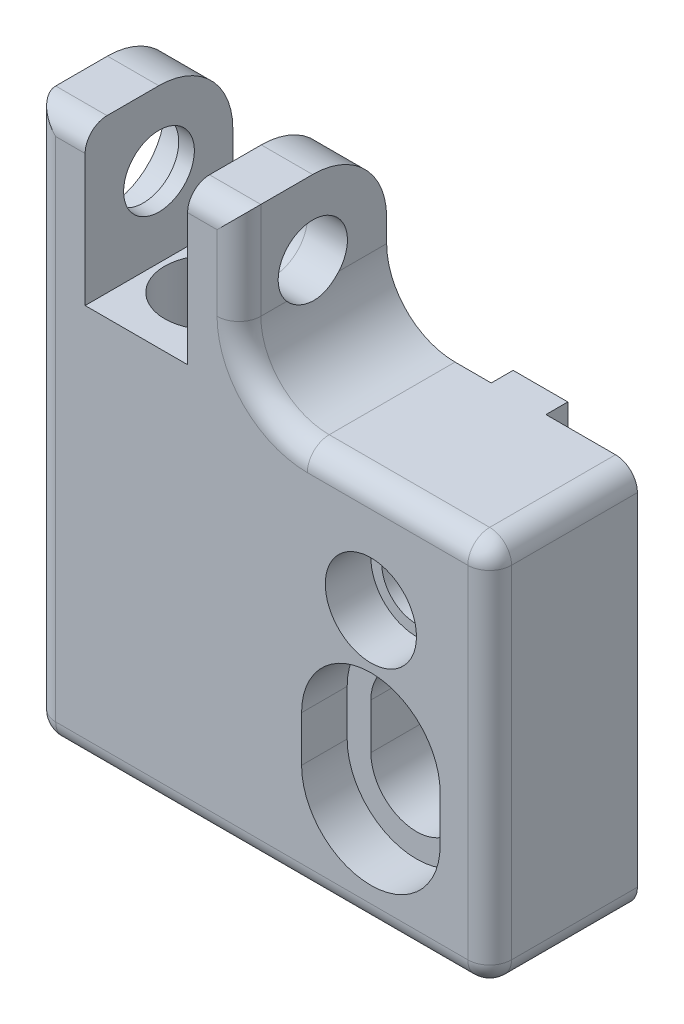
ISO-10303-21;
HEADER;
FILE_DESCRIPTION(('STEP AP214'),'2;1');
FILE_NAME('part.step','',(''),(''),'','','');
FILE_SCHEMA(('AUTOMOTIVE_DESIGN { 1 0 10303 214 1 1 1 1 }'));
ENDSEC;
DATA;
#1=APPLICATION_CONTEXT('core data for automotive mechanical design processes');
#2=APPLICATION_PROTOCOL_DEFINITION('international standard','automotive_design',2000,#1);
#3=PRODUCT_CONTEXT('',#1,'mechanical');
#4=PRODUCT('Part','Part','',(#3));
#5=PRODUCT_RELATED_PRODUCT_CATEGORY('part','',(#4));
#6=PRODUCT_DEFINITION_FORMATION('','',#4);
#7=PRODUCT_DEFINITION_CONTEXT('part definition',#1,'design');
#8=PRODUCT_DEFINITION('design','',#6,#7);
#9=PRODUCT_DEFINITION_SHAPE('','',#8);
#10=(LENGTH_UNIT() NAMED_UNIT(*) SI_UNIT(.MILLI.,.METRE.));
#11=(NAMED_UNIT(*) PLANE_ANGLE_UNIT() SI_UNIT($,.RADIAN.));
#12=(NAMED_UNIT(*) SI_UNIT($,.STERADIAN.) SOLID_ANGLE_UNIT());
#13=UNCERTAINTY_MEASURE_WITH_UNIT(LENGTH_MEASURE(1.E-05),#10,'distance_accuracy_value','');
#14=(GEOMETRIC_REPRESENTATION_CONTEXT(3) GLOBAL_UNCERTAINTY_ASSIGNED_CONTEXT((#13)) GLOBAL_UNIT_ASSIGNED_CONTEXT((#10,
#11,#12)) REPRESENTATION_CONTEXT('',''));
#15=CARTESIAN_POINT('',(0.,0.,0.));
#16=DIRECTION('',(0.,0.,1.));
#17=DIRECTION('',(1.,0.,0.));
#18=AXIS2_PLACEMENT_3D('',#15,#16,#17);
#19=CARTESIAN_POINT('',(-12.7635,8.4328,5.1435));
#20=DIRECTION('',(1.,0.,0.));
#21=DIRECTION('',(0.,0.,-1.));
#22=AXIS2_PLACEMENT_3D('',#19,#20,#21);
#23=PLANE('',#22);
#24=DIRECTION('',(0.,-1.,0.));
#25=VECTOR('',#24,1.);
#26=CARTESIAN_POINT('',(-12.7635,8.4328,5.1435));
#27=LINE('',#26,#25);
#28=CARTESIAN_POINT('',(-12.7635,17.6022,5.1435));
#29=VERTEX_POINT('',#28);
#30=CARTESIAN_POINT('',(-12.7635,8.4328,5.1435));
#31=VERTEX_POINT('',#30);
#32=EDGE_CURVE('E633',#29,#31,#27,.T.);
#33=ORIENTED_EDGE('',*,*,#32,.F.);
#34=CARTESIAN_POINT('',(-12.7635,17.6022,3.6195));
#35=DIRECTION('',(1.,0.,0.));
#36=DIRECTION('',(0.,0.,-1.));
#37=AXIS2_PLACEMENT_3D('',#34,#35,#36);
#38=CIRCLE('',#37,1.524);
#39=CARTESIAN_POINT('',(-12.7635,19.1262,3.6195));
#40=VERTEX_POINT('',#39);
#41=EDGE_CURVE('E46',#29,#40,#38,.F.);
#42=ORIENTED_EDGE('',*,*,#41,.T.);
#43=DIRECTION('',(0.,0.,-1.));
#44=VECTOR('',#43,1.);
#45=CARTESIAN_POINT('',(-12.7635,19.1262,5.1435));
#46=LINE('',#45,#44);
#47=CARTESIAN_POINT('',(-12.7635,19.1262,0.0127));
#48=VERTEX_POINT('',#47);
#49=EDGE_CURVE('E716',#40,#48,#46,.T.);
#50=ORIENTED_EDGE('',*,*,#49,.T.);
#51=CARTESIAN_POINT('',(-12.7635,13.97,0.0127));
#52=DIRECTION('',(1.,0.,0.));
#53=DIRECTION('',(0.,0.,-1.));
#54=AXIS2_PLACEMENT_3D('',#51,#52,#53);
#55=CIRCLE('',#54,5.1562);
#56=CARTESIAN_POINT('',(-12.7635,13.97,-5.1435));
#57=VERTEX_POINT('',#56);
#58=EDGE_CURVE('E746',#48,#57,#55,.F.);
#59=ORIENTED_EDGE('',*,*,#58,.T.);
#60=DIRECTION('',(0.,-1.,0.));
#61=VECTOR('',#60,1.);
#62=CARTESIAN_POINT('',(-12.7635,8.4328,-5.1435));
#63=LINE('',#62,#61);
#64=CARTESIAN_POINT('',(-12.7635,8.4328,-5.1435));
#65=VERTEX_POINT('',#64);
#66=EDGE_CURVE('E637',#57,#65,#63,.T.);
#67=ORIENTED_EDGE('',*,*,#66,.T.);
#68=DIRECTION('',(0.,0.,-1.));
#69=VECTOR('',#68,1.);
#70=CARTESIAN_POINT('',(-12.7635,8.4328,5.1435));
#71=LINE('',#70,#69);
#72=EDGE_CURVE('E719',#31,#65,#71,.T.);
#73=ORIENTED_EDGE('',*,*,#72,.F.);
#74=EDGE_LOOP('',(#33,#42,#50,#59,#67,#73));
#75=FACE_BOUND('',#74,.T.);
#76=CARTESIAN_POINT('',(-12.7635,13.97,0.));
#77=DIRECTION('',(1.,0.,0.));
#78=DIRECTION('',(0.,0.,-1.));
#79=AXIS2_PLACEMENT_3D('',#76,#77,#78);
#80=CIRCLE('',#79,2.4638);
#81=CARTESIAN_POINT('',(-12.7635,13.97,-2.4638));
#82=VERTEX_POINT('',#81);
#83=EDGE_CURVE('E337',#82,#82,#80,.F.);
#84=ORIENTED_EDGE('',*,*,#83,.F.);
#85=EDGE_LOOP('',(#84));
#86=FACE_BOUND('',#85,.T.);
#87=ADVANCED_FACE('F37',(#75,#86),#23,.F.);
#88=CARTESIAN_POINT('',(-19.9009,19.1262,5.1435));
#89=DIRECTION('',(-1.,0.,0.));
#90=DIRECTION('',(0.,-1.,0.));
#91=AXIS2_PLACEMENT_3D('',#88,#89,#90);
#92=PLANE('',#91);
#93=DIRECTION('',(0.,0.,-1.));
#94=VECTOR('',#93,1.);
#95=CARTESIAN_POINT('',(-19.9009,19.1262,5.1435));
#96=LINE('',#95,#94);
#97=CARTESIAN_POINT('',(-19.9009,19.1262,3.6195));
#98=VERTEX_POINT('',#97);
#99=CARTESIAN_POINT('',(-19.9009,19.1262,0.0127));
#100=VERTEX_POINT('',#99);
#101=EDGE_CURVE('E558',#98,#100,#96,.T.);
#102=ORIENTED_EDGE('',*,*,#101,.F.);
#103=CARTESIAN_POINT('',(-19.9009,17.6022,3.6195));
#104=DIRECTION('',(-1.,0.,0.));
#105=DIRECTION('',(0.,-1.,0.));
#106=AXIS2_PLACEMENT_3D('',#103,#104,#105);
#107=CIRCLE('',#106,1.524);
#108=CARTESIAN_POINT('',(-19.9009,17.6022,5.1435));
#109=VERTEX_POINT('',#108);
#110=EDGE_CURVE('E550',#98,#109,#107,.F.);
#111=ORIENTED_EDGE('',*,*,#110,.T.);
#112=DIRECTION('',(0.,1.,0.));
#113=VECTOR('',#112,1.);
#114=CARTESIAN_POINT('',(-19.9009,19.1262,5.1435));
#115=LINE('',#114,#113);
#116=CARTESIAN_POINT('',(-19.9009,8.4328,5.1435));
#117=VERTEX_POINT('',#116);
#118=EDGE_CURVE('E556',#117,#109,#115,.T.);
#119=ORIENTED_EDGE('',*,*,#118,.F.);
#120=DIRECTION('',(0.,0.,-1.));
#121=VECTOR('',#120,1.);
#122=CARTESIAN_POINT('',(-19.9009,8.4328,5.1435));
#123=LINE('',#122,#121);
#124=CARTESIAN_POINT('',(-19.9009,8.4328,-5.1435));
#125=VERTEX_POINT('',#124);
#126=EDGE_CURVE('E722',#117,#125,#123,.T.);
#127=ORIENTED_EDGE('',*,*,#126,.T.);
#128=DIRECTION('',(0.,1.,0.));
#129=VECTOR('',#128,1.);
#130=CARTESIAN_POINT('',(-19.9009,19.1262,-5.1435));
#131=LINE('',#130,#129);
#132=CARTESIAN_POINT('',(-19.9009,13.97,-5.1435));
#133=VERTEX_POINT('',#132);
#134=EDGE_CURVE('E641',#125,#133,#131,.T.);
#135=ORIENTED_EDGE('',*,*,#134,.T.);
#136=CARTESIAN_POINT('',(-19.9009,13.97,0.0127));
#137=DIRECTION('',(-1.,0.,0.));
#138=DIRECTION('',(0.,-1.,0.));
#139=AXIS2_PLACEMENT_3D('',#136,#137,#138);
#140=CIRCLE('',#139,5.1562);
#141=EDGE_CURVE('E754',#133,#100,#140,.F.);
#142=ORIENTED_EDGE('',*,*,#141,.T.);
#143=EDGE_LOOP('',(#102,#111,#119,#127,#135,#142));
#144=FACE_BOUND('',#143,.T.);
#145=CARTESIAN_POINT('',(-19.9009,13.97,0.));
#146=DIRECTION('',(-1.,0.,0.));
#147=DIRECTION('',(0.,-1.,0.));
#148=AXIS2_PLACEMENT_3D('',#145,#146,#147);
#149=CIRCLE('',#148,2.4638);
#150=CARTESIAN_POINT('',(-19.9009,11.5062,0.));
#151=VERTEX_POINT('',#150);
#152=EDGE_CURVE('E333',#151,#151,#149,.F.);
#153=ORIENTED_EDGE('',*,*,#152,.F.);
#154=EDGE_LOOP('',(#153));
#155=FACE_BOUND('',#154,.T.);
#156=ADVANCED_FACE('F406',(#144,#155),#92,.F.);
#157=CARTESIAN_POINT('',(-23.47595,-19.2278,5.1435));
#158=DIRECTION('',(1.,0.,0.));
#159=DIRECTION('',(0.,1.,0.));
#160=AXIS2_PLACEMENT_3D('',#157,#158,#159);
#161=PLANE('',#160);
#162=DIRECTION('',(0.,-1.,0.));
#163=VECTOR('',#162,1.);
#164=CARTESIAN_POINT('',(-23.47595,-19.2278,-5.1435));
#165=LINE('',#164,#163);
#166=CARTESIAN_POINT('',(-23.47595,13.97,-5.1435));
#167=VERTEX_POINT('',#166);
#168=CARTESIAN_POINT('',(-23.47595,-17.7038,-5.1435));
#169=VERTEX_POINT('',#168);
#170=EDGE_CURVE('E507',#167,#169,#165,.T.);
#171=ORIENTED_EDGE('',*,*,#170,.T.);
#172=DIRECTION('',(0.,0.,-1.));
#173=VECTOR('',#172,1.);
#174=CARTESIAN_POINT('',(-23.47595,-17.7038,5.1435));
#175=LINE('',#174,#173);
#176=CARTESIAN_POINT('',(-23.47595,-17.7038,3.6195));
#177=VERTEX_POINT('',#176);
#178=EDGE_CURVE('E386',#169,#177,#175,.F.);
#179=ORIENTED_EDGE('',*,*,#178,.T.);
#180=DIRECTION('',(0.,-1.,0.));
#181=VECTOR('',#180,1.);
#182=CARTESIAN_POINT('',(-23.47595,19.1262,3.6195));
#183=LINE('',#182,#181);
#184=CARTESIAN_POINT('',(-23.47595,12.3576000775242,3.6195));
#185=VERTEX_POINT('',#184);
#186=EDGE_CURVE('E500',#177,#185,#183,.F.);
#187=ORIENTED_EDGE('',*,*,#186,.T.);
#188=CARTESIAN_POINT('',(-23.47595,13.97,0.));
#189=DIRECTION('',(-1.,0.,0.));
#190=DIRECTION('',(0.,0.,1.));
#191=AXIS2_PLACEMENT_3D('',#188,#189,#190);
#192=CIRCLE('',#191,3.9624);
#193=CARTESIAN_POINT('',(-23.47595,15.5823999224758,3.6195));
#194=VERTEX_POINT('',#193);
#195=EDGE_CURVE('E334',#194,#185,#192,.T.);
#196=ORIENTED_EDGE('',*,*,#195,.F.);
#197=DIRECTION('',(0.,-1.,0.));
#198=VECTOR('',#197,1.);
#199=CARTESIAN_POINT('',(-23.47595,19.1262,3.6195));
#200=LINE('',#199,#198);
#201=CARTESIAN_POINT('',(-23.47595,19.1262,3.6195));
#202=VERTEX_POINT('',#201);
#203=EDGE_CURVE('E499',#194,#202,#200,.F.);
#204=ORIENTED_EDGE('',*,*,#203,.T.);
#205=DIRECTION('',(0.,0.,-1.));
#206=VECTOR('',#205,1.);
#207=CARTESIAN_POINT('',(-23.47595,19.1262,5.1435));
#208=LINE('',#207,#206);
#209=CARTESIAN_POINT('',(-23.47595,19.1262,0.0127));
#210=VERTEX_POINT('',#209);
#211=EDGE_CURVE('E725',#202,#210,#208,.T.);
#212=ORIENTED_EDGE('',*,*,#211,.T.);
#213=CARTESIAN_POINT('',(-23.47595,13.97,0.0127));
#214=DIRECTION('',(1.,0.,0.));
#215=DIRECTION('',(0.,1.,0.));
#216=AXIS2_PLACEMENT_3D('',#213,#214,#215);
#217=CIRCLE('',#216,5.1562);
#218=EDGE_CURVE('E752',#210,#167,#217,.F.);
#219=ORIENTED_EDGE('',*,*,#218,.T.);
#220=EDGE_LOOP('',(#171,#179,#187,#196,#204,#212,#219));
#221=FACE_BOUND('',#220,.T.);
#222=ADVANCED_FACE('F411',(#221),#161,.F.);
#223=CARTESIAN_POINT('',(-4.42595,12.379325,5.1435));
#224=DIRECTION('',(0.,0.,-1.));
#225=DIRECTION('',(-1.,0.,0.));
#226=AXIS2_PLACEMENT_3D('',#223,#224,#225);
#227=CYLINDRICAL_SURFACE('',#226,4.7625);
#228=DIRECTION('',(0.,0.,-1.));
#229=VECTOR('',#228,1.);
#230=CARTESIAN_POINT('',(-9.18845,12.379325,5.1435));
#231=LINE('',#230,#229);
#232=CARTESIAN_POINT('',(-9.18845,12.379325,3.6195));
#233=VERTEX_POINT('',#232);
#234=CARTESIAN_POINT('',(-9.18845,12.379325,1.81447569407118));
#235=VERTEX_POINT('',#234);
#236=EDGE_CURVE('E311',#233,#235,#231,.T.);
#237=ORIENTED_EDGE('',*,*,#236,.F.);
#238=CARTESIAN_POINT('',(-4.42595,12.379325,3.6195));
#239=DIRECTION('',(0.,0.,1.));
#240=DIRECTION('',(1.,0.,0.));
#241=AXIS2_PLACEMENT_3D('',#238,#239,#240);
#242=CIRCLE('',#241,4.7625);
#243=CARTESIAN_POINT('',(-4.42594999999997,7.616825,3.6195));
#244=VERTEX_POINT('',#243);
#245=EDGE_CURVE('E571',#233,#244,#242,.T.);
#246=ORIENTED_EDGE('',*,*,#245,.T.);
#247=DIRECTION('',(0.,0.,-1.));
#248=VECTOR('',#247,1.);
#249=CARTESIAN_POINT('',(-4.42594999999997,7.616825,5.1435));
#250=LINE('',#249,#248);
#251=CARTESIAN_POINT('',(-4.42594999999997,7.616825,-5.1435));
#252=VERTEX_POINT('',#251);
#253=EDGE_CURVE('E322',#244,#252,#250,.T.);
#254=ORIENTED_EDGE('',*,*,#253,.T.);
#255=CARTESIAN_POINT('',(-4.42595,12.379325,-5.1435));
#256=DIRECTION('',(0.,0.,-1.));
#257=DIRECTION('',(1.,0.,0.));
#258=AXIS2_PLACEMENT_3D('',#255,#256,#257);
#259=CIRCLE('',#258,4.7625);
#260=CARTESIAN_POINT('',(-9.18845,12.379325,-5.1435));
#261=VERTEX_POINT('',#260);
#262=EDGE_CURVE('E584',#252,#261,#259,.T.);
#263=ORIENTED_EDGE('',*,*,#262,.T.);
#264=CARTESIAN_POINT('',(-9.18845,12.379325,-1.81447569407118));
#265=VERTEX_POINT('',#264);
#266=EDGE_CURVE('E323',#265,#261,#231,.T.);
#267=ORIENTED_EDGE('',*,*,#266,.F.);
#268=CARTESIAN_POINT('',(-9.18845,12.379325,1.81447569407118));
#269=CARTESIAN_POINT('',(-9.18845051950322,12.3284926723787,1.76991383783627));
#270=CARTESIAN_POINT('',(-9.18763620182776,12.2795648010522,1.72324034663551));
#271=CARTESIAN_POINT('',(-9.18474810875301,12.1858216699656,1.62598894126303));
#272=CARTESIAN_POINT('',(-9.18267465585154,12.1410053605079,1.57541202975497));
#273=CARTESIAN_POINT('',(-9.1751283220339,12.0132844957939,1.41844408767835));
#274=CARTESIAN_POINT('',(-9.16832697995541,11.9369354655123,1.3066642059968));
#275=CARTESIAN_POINT('',(-9.15404940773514,11.8040200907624,1.07205430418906));
#276=CARTESIAN_POINT('',(-9.14657329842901,11.7474502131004,0.94922626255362));
#277=CARTESIAN_POINT('',(-9.13336293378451,11.6555605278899,0.695767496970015));
#278=CARTESIAN_POINT('',(-9.12762839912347,11.6202373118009,0.5651380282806));
#279=CARTESIAN_POINT('',(-9.11954863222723,11.5717619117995,0.29901770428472));
#280=CARTESIAN_POINT('',(-9.11722109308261,11.5587254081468,0.163505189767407));
#281=CARTESIAN_POINT('',(-9.11667278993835,11.5555962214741,-0.1077892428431));
#282=CARTESIAN_POINT('',(-9.11845169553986,11.5655016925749,-0.243571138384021));
#283=CARTESIAN_POINT('',(-9.1255599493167,11.6076312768,-0.509593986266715));
#284=CARTESIAN_POINT('',(-9.13084051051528,11.6395489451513,-0.639885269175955));
#285=CARTESIAN_POINT('',(-9.14341136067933,11.7245006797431,-0.893396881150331));
#286=CARTESIAN_POINT('',(-9.1507023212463,11.7775418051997,-1.01661483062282));
#287=CARTESIAN_POINT('',(-9.16173886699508,11.8744727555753,-1.19859261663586));
#288=CARTESIAN_POINT('',(-9.16558382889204,11.9114904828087,-1.26110443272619));
#289=CARTESIAN_POINT('',(-9.17276295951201,11.9910331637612,-1.38257873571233));
#290=CARTESIAN_POINT('',(-9.17609711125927,12.0335583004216,-1.44154110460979));
#291=CARTESIAN_POINT('',(-9.18180799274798,12.1238496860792,-1.55550305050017));
#292=CARTESIAN_POINT('',(-9.18418323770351,12.1716239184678,-1.61049637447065));
#293=CARTESIAN_POINT('',(-9.18750495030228,12.2719739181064,-1.71598042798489));
#294=CARTESIAN_POINT('',(-9.18845109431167,12.3245507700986,-1.76647013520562));
#295=CARTESIAN_POINT('',(-9.18845,12.379325,-1.81447569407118));
#296=B_SPLINE_CURVE_WITH_KNOTS('',3,(#268,#269,#270,#271,#272,#273,#274,#275,#276,#277,#278,
#279,#280,#281,#282,#283,#284,#285,#286,#287,#288,#289,#290,#291,#292,#293,#294,#295),
.UNSPECIFIED.,.F.,.F.,(4,2,2,2,2,2,2,2,2,2,2,2,2,4),(0.,0.202658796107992,0.405265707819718,
0.809799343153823,1.21426067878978,1.61865711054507,2.02514627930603,2.43160274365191,
2.83251198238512,3.23355531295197,3.45156007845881,3.66957208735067,3.88792038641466,
4.10631812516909),.UNSPECIFIED.);
#297=EDGE_CURVE('E327',#235,#265,#296,.T.);
#298=ORIENTED_EDGE('',*,*,#297,.F.);
#299=EDGE_LOOP('',(#237,#246,#254,#263,#267,#298));
#300=FACE_BOUND('',#299,.T.);
#301=ADVANCED_FACE('F331',(#300),#227,.F.);
#302=CARTESIAN_POINT('',(-9.18845,19.1262,5.1435));
#303=DIRECTION('',(-1.,0.,0.));
#304=DIRECTION('',(0.,0.,1.));
#305=AXIS2_PLACEMENT_3D('',#302,#303,#304);
#306=PLANE('',#305);
#307=DIRECTION('',(0.,0.,-1.));
#308=VECTOR('',#307,1.);
#309=CARTESIAN_POINT('',(-9.18845,19.1262,5.1435));
#310=LINE('',#309,#308);
#311=CARTESIAN_POINT('',(-9.18845,19.1262,3.6195));
#312=VERTEX_POINT('',#311);
#313=CARTESIAN_POINT('',(-9.18845,19.1262,0.0127));
#314=VERTEX_POINT('',#313);
#315=EDGE_CURVE('E566',#312,#314,#310,.T.);
#316=ORIENTED_EDGE('',*,*,#315,.F.);
#317=DIRECTION('',(0.,1.,0.));
#318=VECTOR('',#317,1.);
#319=CARTESIAN_POINT('',(-9.18845,12.379325,3.6195));
#320=LINE('',#319,#318);
#321=EDGE_CURVE('E318',#312,#233,#320,.F.);
#322=ORIENTED_EDGE('',*,*,#321,.T.);
#323=ORIENTED_EDGE('',*,*,#236,.T.);
#324=CARTESIAN_POINT('',(-9.18845,13.97,0.));
#325=DIRECTION('',(-1.,0.,0.));
#326=DIRECTION('',(0.,0.,1.));
#327=AXIS2_PLACEMENT_3D('',#324,#325,#326);
#328=CIRCLE('',#327,2.413);
#329=EDGE_CURVE('E315',#265,#235,#328,.F.);
#330=ORIENTED_EDGE('',*,*,#329,.F.);
#331=ORIENTED_EDGE('',*,*,#266,.T.);
#332=DIRECTION('',(0.,1.,0.));
#333=VECTOR('',#332,1.);
#334=CARTESIAN_POINT('',(-9.18845,19.1262,-5.1435));
#335=LINE('',#334,#333);
#336=CARTESIAN_POINT('',(-9.18845,13.97,-5.1435));
#337=VERTEX_POINT('',#336);
#338=EDGE_CURVE('E635',#261,#337,#335,.T.);
#339=ORIENTED_EDGE('',*,*,#338,.T.);
#340=CARTESIAN_POINT('',(-9.18845,13.97,0.0127));
#341=DIRECTION('',(-1.,0.,0.));
#342=DIRECTION('',(0.,0.,1.));
#343=AXIS2_PLACEMENT_3D('',#340,#341,#342);
#344=CIRCLE('',#343,5.1562);
#345=EDGE_CURVE('E741',#337,#314,#344,.F.);
#346=ORIENTED_EDGE('',*,*,#345,.T.);
#347=EDGE_LOOP('',(#316,#322,#323,#330,#331,#339,#346));
#348=FACE_BOUND('',#347,.T.);
#349=ADVANCED_FACE('F314',(#348),#306,.F.);
#350=CARTESIAN_POINT('',(0.,0.,5.1435));
#351=DIRECTION('',(0.,0.,-1.));
#352=DIRECTION('',(-1.,0.,0.));
#353=AXIS2_PLACEMENT_3D('',#350,#351,#352);
#354=CYLINDRICAL_SURFACE('',#353,2.413);
#355=CARTESIAN_POINT('',(0.,0.,-5.1435));
#356=DIRECTION('',(0.,0.,1.));
#357=DIRECTION('',(1.,0.,0.));
#358=AXIS2_PLACEMENT_3D('',#355,#356,#357);
#359=CIRCLE('',#358,2.413);
#360=CARTESIAN_POINT('',(-1.905,1.4810617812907,-5.1435));
#361=VERTEX_POINT('',#360);
#362=CARTESIAN_POINT('',(-1.905,-1.4810617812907,-5.1435));
#363=VERTEX_POINT('',#362);
#364=EDGE_CURVE('E597',#361,#363,#359,.T.);
#365=ORIENTED_EDGE('',*,*,#364,.F.);
#366=DIRECTION('',(0.,0.,1.));
#367=VECTOR('',#366,1.);
#368=CARTESIAN_POINT('',(-1.905,1.4810617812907,-6.6675));
#369=LINE('',#368,#367);
#370=CARTESIAN_POINT('',(-1.905,1.4810617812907,-6.6675));
#371=VERTEX_POINT('',#370);
#372=EDGE_CURVE('E695',#371,#361,#369,.T.);
#373=ORIENTED_EDGE('',*,*,#372,.F.);
#374=CARTESIAN_POINT('',(0.,0.,-6.6675));
#375=DIRECTION('',(0.,0.,1.));
#376=DIRECTION('',(-1.,0.,0.));
#377=AXIS2_PLACEMENT_3D('',#374,#375,#376);
#378=CIRCLE('',#377,2.413);
#379=CARTESIAN_POINT('',(1.905,1.48106178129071,-6.6675));
#380=VERTEX_POINT('',#379);
#381=EDGE_CURVE('E694',#380,#371,#378,.T.);
#382=ORIENTED_EDGE('',*,*,#381,.F.);
#383=DIRECTION('',(0.,0.,1.));
#384=VECTOR('',#383,1.);
#385=CARTESIAN_POINT('',(1.905,1.48106178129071,-6.6675));
#386=LINE('',#385,#384);
#387=CARTESIAN_POINT('',(1.905,1.48106178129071,-5.1435));
#388=VERTEX_POINT('',#387);
#389=EDGE_CURVE('E605',#380,#388,#386,.T.);
#390=ORIENTED_EDGE('',*,*,#389,.T.);
#391=CARTESIAN_POINT('',(1.905,-1.48106178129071,-5.1435));
#392=VERTEX_POINT('',#391);
#393=EDGE_CURVE('E632',#392,#388,#359,.T.);
#394=ORIENTED_EDGE('',*,*,#393,.F.);
#395=DIRECTION('',(0.,0.,1.));
#396=VECTOR('',#395,1.);
#397=CARTESIAN_POINT('',(1.905,-1.48106178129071,-6.6675));
#398=LINE('',#397,#396);
#399=CARTESIAN_POINT('',(1.905,-1.48106178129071,-6.6675));
#400=VERTEX_POINT('',#399);
#401=EDGE_CURVE('E666',#400,#392,#398,.T.);
#402=ORIENTED_EDGE('',*,*,#401,.F.);
#403=CARTESIAN_POINT('',(0.,0.,-6.6675));
#404=DIRECTION('',(0.,0.,1.));
#405=DIRECTION('',(-1.,0.,0.));
#406=AXIS2_PLACEMENT_3D('',#403,#404,#405);
#407=CIRCLE('',#406,2.413);
#408=CARTESIAN_POINT('',(-1.905,-1.4810617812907,-6.6675));
#409=VERTEX_POINT('',#408);
#410=EDGE_CURVE('E1357',#409,#400,#407,.T.);
#411=ORIENTED_EDGE('',*,*,#410,.F.);
#412=DIRECTION('',(0.,0.,1.));
#413=VECTOR('',#412,1.);
#414=CARTESIAN_POINT('',(-1.905,-1.4810617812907,-6.6675));
#415=LINE('',#414,#413);
#416=EDGE_CURVE('E1354',#409,#363,#415,.T.);
#417=ORIENTED_EDGE('',*,*,#416,.T.);
#418=EDGE_LOOP('',(#365,#373,#382,#390,#394,#402,#411,#417));
#419=FACE_BOUND('',#418,.T.);
#420=CARTESIAN_POINT('',(0.,0.,1.9685));
#421=DIRECTION('',(0.,0.,1.));
#422=DIRECTION('',(1.,0.,0.));
#423=AXIS2_PLACEMENT_3D('',#420,#421,#422);
#424=CIRCLE('',#423,2.413);
#425=CARTESIAN_POINT('',(2.413,0.,1.9685));
#426=VERTEX_POINT('',#425);
#427=EDGE_CURVE('E1438',#426,#426,#424,.T.);
#428=ORIENTED_EDGE('',*,*,#427,.T.);
#429=EDGE_LOOP('',(#428));
#430=FACE_BOUND('',#429,.T.);
#431=ADVANCED_FACE('F1006',(#419,#430),#354,.F.);
#432=CARTESIAN_POINT('',(0.,-8.5852,5.1435));
#433=DIRECTION('',(0.,0.,-1.));
#434=DIRECTION('',(-1.,0.,0.));
#435=AXIS2_PLACEMENT_3D('',#432,#433,#434);
#436=CYLINDRICAL_SURFACE('',#435,3.175);
#437=DIRECTION('',(0.,0.,-1.));
#438=VECTOR('',#437,1.);
#439=CARTESIAN_POINT('',(3.175,-8.5852,5.1435));
#440=LINE('',#439,#438);
#441=CARTESIAN_POINT('',(3.175,-8.5852,1.9685));
#442=VERTEX_POINT('',#441);
#443=CARTESIAN_POINT('',(3.175,-8.5852,-5.1435));
#444=VERTEX_POINT('',#443);
#445=EDGE_CURVE('E624',#442,#444,#440,.T.);
#446=ORIENTED_EDGE('',*,*,#445,.F.);
#447=CARTESIAN_POINT('',(0.,-8.5852,1.9685));
#448=DIRECTION('',(0.,0.,1.));
#449=DIRECTION('',(1.,0.,0.));
#450=AXIS2_PLACEMENT_3D('',#447,#448,#449);
#451=CIRCLE('',#450,3.175);
#452=CARTESIAN_POINT('',(-3.175,-8.5852,1.9685));
#453=VERTEX_POINT('',#452);
#454=EDGE_CURVE('E1391',#442,#453,#451,.T.);
#455=ORIENTED_EDGE('',*,*,#454,.T.);
#456=DIRECTION('',(0.,0.,-1.));
#457=VECTOR('',#456,1.);
#458=CARTESIAN_POINT('',(-3.175,-8.5852,5.1435));
#459=LINE('',#458,#457);
#460=CARTESIAN_POINT('',(-3.175,-8.5852,-5.1435));
#461=VERTEX_POINT('',#460);
#462=EDGE_CURVE('E630',#453,#461,#459,.T.);
#463=ORIENTED_EDGE('',*,*,#462,.T.);
#464=CARTESIAN_POINT('',(0.,-8.5852,-5.1435));
#465=DIRECTION('',(0.,0.,1.));
#466=DIRECTION('',(1.,0.,0.));
#467=AXIS2_PLACEMENT_3D('',#464,#465,#466);
#468=CIRCLE('',#467,3.175);
#469=CARTESIAN_POINT('',(-1.905,-6.0452,-5.1435));
#470=VERTEX_POINT('',#469);
#471=EDGE_CURVE('E615',#470,#461,#468,.T.);
#472=ORIENTED_EDGE('',*,*,#471,.F.);
#473=DIRECTION('',(0.,0.,1.));
#474=VECTOR('',#473,1.);
#475=CARTESIAN_POINT('',(-1.905,-6.0452,-6.6675));
#476=LINE('',#475,#474);
#477=CARTESIAN_POINT('',(-1.905,-6.0452,-6.6675));
#478=VERTEX_POINT('',#477);
#479=EDGE_CURVE('E1359',#478,#470,#476,.T.);
#480=ORIENTED_EDGE('',*,*,#479,.F.);
#481=CARTESIAN_POINT('',(0.,-8.5852,-6.6675));
#482=DIRECTION('',(0.,0.,1.));
#483=DIRECTION('',(1.,0.,0.));
#484=AXIS2_PLACEMENT_3D('',#481,#482,#483);
#485=CIRCLE('',#484,3.175);
#486=CARTESIAN_POINT('',(1.905,-6.0452,-6.6675));
#487=VERTEX_POINT('',#486);
#488=EDGE_CURVE('E1365',#487,#478,#485,.T.);
#489=ORIENTED_EDGE('',*,*,#488,.F.);
#490=DIRECTION('',(0.,0.,1.));
#491=VECTOR('',#490,1.);
#492=CARTESIAN_POINT('',(1.905,-6.0452,-6.6675));
#493=LINE('',#492,#491);
#494=CARTESIAN_POINT('',(1.905,-6.0452,-5.1435));
#495=VERTEX_POINT('',#494);
#496=EDGE_CURVE('E1363',#487,#495,#493,.T.);
#497=ORIENTED_EDGE('',*,*,#496,.T.);
#498=EDGE_CURVE('E612',#444,#495,#468,.T.);
#499=ORIENTED_EDGE('',*,*,#498,.F.);
#500=EDGE_LOOP('',(#446,#455,#463,#472,#480,#489,#497,#499));
#501=FACE_BOUND('',#500,.T.);
#502=ADVANCED_FACE('F1178',(#501),#436,.F.);
#503=CARTESIAN_POINT('',(-3.175,-8.5852,5.1435));
#504=DIRECTION('',(1.,0.,0.));
#505=DIRECTION('',(0.,1.,0.));
#506=AXIS2_PLACEMENT_3D('',#503,#504,#505);
#507=PLANE('',#506);
#508=ORIENTED_EDGE('',*,*,#462,.F.);
#509=DIRECTION('',(0.,-1.,0.));
#510=VECTOR('',#509,1.);
#511=CARTESIAN_POINT('',(-3.175,-8.5852,1.9685));
#512=LINE('',#511,#510);
#513=CARTESIAN_POINT('',(-3.175,-11.7602,1.9685));
#514=VERTEX_POINT('',#513);
#515=EDGE_CURVE('E1389',#453,#514,#512,.T.);
#516=ORIENTED_EDGE('',*,*,#515,.T.);
#517=DIRECTION('',(0.,0.,-1.));
#518=VECTOR('',#517,1.);
#519=CARTESIAN_POINT('',(-3.175,-11.7602,5.1435));
#520=LINE('',#519,#518);
#521=CARTESIAN_POINT('',(-3.175,-11.7602,-5.1435));
#522=VERTEX_POINT('',#521);
#523=EDGE_CURVE('E628',#514,#522,#520,.T.);
#524=ORIENTED_EDGE('',*,*,#523,.T.);
#525=DIRECTION('',(0.,-1.,0.));
#526=VECTOR('',#525,1.);
#527=CARTESIAN_POINT('',(-3.175,-8.5852,-5.1435));
#528=LINE('',#527,#526);
#529=EDGE_CURVE('E614',#461,#522,#528,.T.);
#530=ORIENTED_EDGE('',*,*,#529,.F.);
#531=EDGE_LOOP('',(#508,#516,#524,#530));
#532=FACE_BOUND('',#531,.T.);
#533=ADVANCED_FACE('F1169',(#532),#507,.T.);
#534=CARTESIAN_POINT('',(0.,-11.7602,5.1435));
#535=DIRECTION('',(0.,0.,-1.));
#536=DIRECTION('',(-1.,0.,0.));
#537=AXIS2_PLACEMENT_3D('',#534,#535,#536);
#538=CYLINDRICAL_SURFACE('',#537,3.175);
#539=ORIENTED_EDGE('',*,*,#523,.F.);
#540=CARTESIAN_POINT('',(0.,-11.7602,1.9685));
#541=DIRECTION('',(0.,0.,1.));
#542=DIRECTION('',(1.,0.,0.));
#543=AXIS2_PLACEMENT_3D('',#540,#541,#542);
#544=CIRCLE('',#543,3.175);
#545=CARTESIAN_POINT('',(3.175,-11.7602,1.9685));
#546=VERTEX_POINT('',#545);
#547=EDGE_CURVE('E1384',#514,#546,#544,.T.);
#548=ORIENTED_EDGE('',*,*,#547,.T.);
#549=DIRECTION('',(0.,0.,-1.));
#550=VECTOR('',#549,1.);
#551=CARTESIAN_POINT('',(3.175,-11.7602,5.1435));
#552=LINE('',#551,#550);
#553=CARTESIAN_POINT('',(3.175,-11.7602,-5.1435));
#554=VERTEX_POINT('',#553);
#555=EDGE_CURVE('E626',#546,#554,#552,.T.);
#556=ORIENTED_EDGE('',*,*,#555,.T.);
#557=CARTESIAN_POINT('',(0.,-11.7602,-5.1435));
#558=DIRECTION('',(0.,0.,1.));
#559=DIRECTION('',(1.,0.,0.));
#560=AXIS2_PLACEMENT_3D('',#557,#558,#559);
#561=CIRCLE('',#560,3.175);
#562=CARTESIAN_POINT('',(1.905,-14.3002,-5.1435));
#563=VERTEX_POINT('',#562);
#564=EDGE_CURVE('E618',#563,#554,#561,.T.);
#565=ORIENTED_EDGE('',*,*,#564,.F.);
#566=DIRECTION('',(0.,0.,1.));
#567=VECTOR('',#566,1.);
#568=CARTESIAN_POINT('',(1.905,-14.3002,-6.6675));
#569=LINE('',#568,#567);
#570=CARTESIAN_POINT('',(1.905,-14.3002,-6.6675));
#571=VERTEX_POINT('',#570);
#572=EDGE_CURVE('E670',#571,#563,#569,.T.);
#573=ORIENTED_EDGE('',*,*,#572,.F.);
#574=CARTESIAN_POINT('',(0.,-11.7602,-6.6675));
#575=DIRECTION('',(0.,0.,1.));
#576=DIRECTION('',(-1.,0.,0.));
#577=AXIS2_PLACEMENT_3D('',#574,#575,#576);
#578=CIRCLE('',#577,3.175);
#579=CARTESIAN_POINT('',(-1.905,-14.3002,-6.6675));
#580=VERTEX_POINT('',#579);
#581=EDGE_CURVE('E677',#580,#571,#578,.T.);
#582=ORIENTED_EDGE('',*,*,#581,.F.);
#583=DIRECTION('',(0.,0.,1.));
#584=VECTOR('',#583,1.);
#585=CARTESIAN_POINT('',(-1.905,-14.3002,-6.6675));
#586=LINE('',#585,#584);
#587=CARTESIAN_POINT('',(-1.905,-14.3002,-5.1435));
#588=VERTEX_POINT('',#587);
#589=EDGE_CURVE('E676',#580,#588,#586,.T.);
#590=ORIENTED_EDGE('',*,*,#589,.T.);
#591=EDGE_CURVE('E619',#522,#588,#561,.T.);
#592=ORIENTED_EDGE('',*,*,#591,.F.);
#593=EDGE_LOOP('',(#539,#548,#556,#565,#573,#582,#590,#592));
#594=FACE_BOUND('',#593,.T.);
#595=ADVANCED_FACE('F1156',(#594),#538,.F.);
#596=CARTESIAN_POINT('',(3.175,-8.5852,5.1435));
#597=DIRECTION('',(-1.,0.,0.));
#598=DIRECTION('',(0.,-1.,0.));
#599=AXIS2_PLACEMENT_3D('',#596,#597,#598);
#600=PLANE('',#599);
#601=ORIENTED_EDGE('',*,*,#555,.F.);
#602=DIRECTION('',(0.,1.,0.));
#603=VECTOR('',#602,1.);
#604=CARTESIAN_POINT('',(3.175,-8.5852,1.9685));
#605=LINE('',#604,#603);
#606=EDGE_CURVE('E329',#546,#442,#605,.T.);
#607=ORIENTED_EDGE('',*,*,#606,.T.);
#608=ORIENTED_EDGE('',*,*,#445,.T.);
#609=DIRECTION('',(0.,1.,0.));
#610=VECTOR('',#609,1.);
#611=CARTESIAN_POINT('',(3.175,-8.5852,-5.1435));
#612=LINE('',#611,#610);
#613=EDGE_CURVE('E621',#554,#444,#612,.T.);
#614=ORIENTED_EDGE('',*,*,#613,.F.);
#615=EDGE_LOOP('',(#601,#607,#608,#614));
#616=FACE_BOUND('',#615,.T.);
#617=ADVANCED_FACE('F1150',(#616),#600,.T.);
#618=CARTESIAN_POINT('',(-19.9009,8.4328,5.1435));
#619=DIRECTION('',(0.,-1.,0.));
#620=DIRECTION('',(1.,0.,0.));
#621=AXIS2_PLACEMENT_3D('',#618,#619,#620);
#622=PLANE('',#621);
#623=DIRECTION('',(-1.,0.,0.));
#624=VECTOR('',#623,1.);
#625=CARTESIAN_POINT('',(-19.9009,8.4328,-5.1435));
#626=LINE('',#625,#624);
#627=EDGE_CURVE('E639',#65,#125,#626,.T.);
#628=ORIENTED_EDGE('',*,*,#627,.T.);
#629=ORIENTED_EDGE('',*,*,#126,.F.);
#630=DIRECTION('',(-1.,0.,0.));
#631=VECTOR('',#630,1.);
#632=CARTESIAN_POINT('',(-19.9009,8.4328,5.1435));
#633=LINE('',#632,#631);
#634=EDGE_CURVE('E564',#31,#117,#633,.T.);
#635=ORIENTED_EDGE('',*,*,#634,.F.);
#636=ORIENTED_EDGE('',*,*,#72,.T.);
#637=EDGE_LOOP('',(#628,#629,#635,#636));
#638=FACE_BOUND('',#637,.T.);
#639=CARTESIAN_POINT('',(-16.3322,8.4328,0.));
#640=DIRECTION('',(0.,-1.,0.));
#641=DIRECTION('',(1.,0.,0.));
#642=AXIS2_PLACEMENT_3D('',#639,#640,#641);
#643=CIRCLE('',#642,3.175);
#644=CARTESIAN_POINT('',(-13.1572,8.4328,0.));
#645=VERTEX_POINT('',#644);
#646=EDGE_CURVE('E712',#645,#645,#643,.F.);
#647=ORIENTED_EDGE('',*,*,#646,.F.);
#648=EDGE_LOOP('',(#647));
#649=FACE_BOUND('',#648,.T.);
#650=ADVANCED_FACE('F417',(#638,#649),#622,.F.);
#651=CARTESIAN_POINT('',(8.27405,-19.2278,5.1435));
#652=DIRECTION('',(0.,1.,0.));
#653=DIRECTION('',(-1.,0.,0.));
#654=AXIS2_PLACEMENT_3D('',#651,#652,#653);
#655=PLANE('',#654);
#656=DIRECTION('',(1.,0.,0.));
#657=VECTOR('',#656,1.);
#658=CARTESIAN_POINT('',(8.27405,-19.2278,-5.1435));
#659=LINE('',#658,#657);
#660=CARTESIAN_POINT('',(1.905,-19.2278,-5.1435));
#661=VERTEX_POINT('',#660);
#662=CARTESIAN_POINT('',(6.75005,-19.2278,-5.1435));
#663=VERTEX_POINT('',#662);
#664=EDGE_CURVE('E644',#661,#663,#659,.T.);
#665=ORIENTED_EDGE('',*,*,#664,.T.);
#666=DIRECTION('',(0.,0.,-1.));
#667=VECTOR('',#666,1.);
#668=CARTESIAN_POINT('',(6.75005,-19.2278,5.1435));
#669=LINE('',#668,#667);
#670=CARTESIAN_POINT('',(6.75005,-19.2278,3.6195));
#671=VERTEX_POINT('',#670);
#672=EDGE_CURVE('E479',#663,#671,#669,.F.);
#673=ORIENTED_EDGE('',*,*,#672,.T.);
#674=DIRECTION('',(1.,0.,0.));
#675=VECTOR('',#674,1.);
#676=CARTESIAN_POINT('',(-23.47595,-19.2278,3.6195));
#677=LINE('',#676,#675);
#678=CARTESIAN_POINT('',(-21.95195,-19.2278,3.6195));
#679=VERTEX_POINT('',#678);
#680=EDGE_CURVE('E483',#671,#679,#677,.F.);
#681=ORIENTED_EDGE('',*,*,#680,.T.);
#682=DIRECTION('',(0.,0.,-1.));
#683=VECTOR('',#682,1.);
#684=CARTESIAN_POINT('',(-21.95195,-19.2278,5.1435));
#685=LINE('',#684,#683);
#686=CARTESIAN_POINT('',(-21.95195,-19.2278,-5.1435));
#687=VERTEX_POINT('',#686);
#688=EDGE_CURVE('E486',#679,#687,#685,.T.);
#689=ORIENTED_EDGE('',*,*,#688,.T.);
#690=CARTESIAN_POINT('',(-1.905,-19.2278,-5.1435));
#691=VERTEX_POINT('',#690);
#692=EDGE_CURVE('E645',#687,#691,#659,.T.);
#693=ORIENTED_EDGE('',*,*,#692,.T.);
#694=DIRECTION('',(0.,0.,1.));
#695=VECTOR('',#694,1.);
#696=CARTESIAN_POINT('',(-1.905,-19.2278,-6.6675));
#697=LINE('',#696,#695);
#698=CARTESIAN_POINT('',(-1.905,-19.2278,-6.6675));
#699=VERTEX_POINT('',#698);
#700=EDGE_CURVE('E680',#699,#691,#697,.T.);
#701=ORIENTED_EDGE('',*,*,#700,.F.);
#702=DIRECTION('',(-1.,0.,0.));
#703=VECTOR('',#702,1.);
#704=CARTESIAN_POINT('',(-1.905,-19.2278,-6.6675));
#705=LINE('',#704,#703);
#706=CARTESIAN_POINT('',(1.905,-19.2278,-6.6675));
#707=VERTEX_POINT('',#706);
#708=EDGE_CURVE('E1376',#707,#699,#705,.T.);
#709=ORIENTED_EDGE('',*,*,#708,.F.);
#710=DIRECTION('',(0.,0.,1.));
#711=VECTOR('',#710,1.);
#712=CARTESIAN_POINT('',(1.905,-19.2278,-6.6675));
#713=LINE('',#712,#711);
#714=EDGE_CURVE('E656',#707,#661,#713,.T.);
#715=ORIENTED_EDGE('',*,*,#714,.T.);
#716=EDGE_LOOP('',(#665,#673,#681,#689,#693,#701,#709,#715));
#717=FACE_BOUND('',#716,.T.);
#718=CARTESIAN_POINT('',(-16.3322,-19.2278,0.));
#719=DIRECTION('',(0.,1.,0.));
#720=DIRECTION('',(-1.,0.,0.));
#721=AXIS2_PLACEMENT_3D('',#718,#719,#720);
#722=CIRCLE('',#721,1.5875);
#723=CARTESIAN_POINT('',(-17.9197,-19.2278,0.));
#724=VERTEX_POINT('',#723);
#725=EDGE_CURVE('E1404',#724,#724,#722,.T.);
#726=ORIENTED_EDGE('',*,*,#725,.T.);
#727=EDGE_LOOP('',(#726));
#728=FACE_BOUND('',#727,.T.);
#729=ADVANCED_FACE('F652',(#717,#728),#655,.F.);
#730=CARTESIAN_POINT('',(-4.42595,12.379325,-5.1435));
#731=DIRECTION('',(0.,0.,1.));
#732=DIRECTION('',(1.,0.,0.));
#733=AXIS2_PLACEMENT_3D('',#730,#731,#732);
#734=PLANE('',#733);
#735=DIRECTION('',(0.,1.,0.));
#736=VECTOR('',#735,1.);
#737=CARTESIAN_POINT('',(8.27405,7.616825,-5.1435));
#738=LINE('',#737,#736);
#739=CARTESIAN_POINT('',(8.27405,-17.7038,-5.1435));
#740=VERTEX_POINT('',#739);
#741=CARTESIAN_POINT('',(8.27405,6.092825,-5.1435));
#742=VERTEX_POINT('',#741);
#743=EDGE_CURVE('E589',#740,#742,#738,.T.);
#744=ORIENTED_EDGE('',*,*,#743,.F.);
#745=CARTESIAN_POINT('',(6.75005,-17.7038,-5.1435));
#746=DIRECTION('',(0.,0.,1.));
#747=DIRECTION('',(1.,0.,0.));
#748=AXIS2_PLACEMENT_3D('',#745,#746,#747);
#749=CIRCLE('',#748,1.524);
#750=EDGE_CURVE('E475',#740,#663,#749,.F.);
#751=ORIENTED_EDGE('',*,*,#750,.T.);
#752=ORIENTED_EDGE('',*,*,#664,.F.);
#753=DIRECTION('',(0.,-1.,0.));
#754=VECTOR('',#753,1.);
#755=CARTESIAN_POINT('',(1.905,-14.3002,-5.1435));
#756=LINE('',#755,#754);
#757=EDGE_CURVE('E661',#563,#661,#756,.T.);
#758=ORIENTED_EDGE('',*,*,#757,.F.);
#759=ORIENTED_EDGE('',*,*,#564,.T.);
#760=ORIENTED_EDGE('',*,*,#613,.T.);
#761=ORIENTED_EDGE('',*,*,#498,.T.);
#762=DIRECTION('',(0.,-1.,0.));
#763=VECTOR('',#762,1.);
#764=CARTESIAN_POINT('',(1.905,-1.48106178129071,-5.1435));
#765=LINE('',#764,#763);
#766=EDGE_CURVE('E1410',#392,#495,#765,.T.);
#767=ORIENTED_EDGE('',*,*,#766,.F.);
#768=ORIENTED_EDGE('',*,*,#393,.T.);
#769=DIRECTION('',(0.,-1.,0.));
#770=VECTOR('',#769,1.);
#771=CARTESIAN_POINT('',(1.905,7.616825,-5.1435));
#772=LINE('',#771,#770);
#773=CARTESIAN_POINT('',(1.905,7.616825,-5.1435));
#774=VERTEX_POINT('',#773);
#775=EDGE_CURVE('E599',#774,#388,#772,.T.);
#776=ORIENTED_EDGE('',*,*,#775,.F.);
#777=DIRECTION('',(-1.,0.,0.));
#778=VECTOR('',#777,1.);
#779=CARTESIAN_POINT('',(-4.42594999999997,7.616825,-5.1435));
#780=LINE('',#779,#778);
#781=CARTESIAN_POINT('',(6.75005,7.616825,-5.1435));
#782=VERTEX_POINT('',#781);
#783=EDGE_CURVE('E582',#782,#774,#780,.T.);
#784=ORIENTED_EDGE('',*,*,#783,.F.);
#785=CARTESIAN_POINT('',(6.75005,6.092825,-5.1435));
#786=DIRECTION('',(0.,0.,1.));
#787=DIRECTION('',(1.,0.,0.));
#788=AXIS2_PLACEMENT_3D('',#785,#786,#787);
#789=CIRCLE('',#788,1.524);
#790=EDGE_CURVE('E484',#782,#742,#789,.F.);
#791=ORIENTED_EDGE('',*,*,#790,.T.);
#792=EDGE_LOOP('',(#744,#751,#752,#758,#759,#760,#761,#767,#768,#776,#784,#791));
#793=FACE_BOUND('',#792,.T.);
#794=ADVANCED_FACE('F659',(#793),#734,.F.);
#795=ORIENTED_EDGE('',*,*,#692,.F.);
#796=CARTESIAN_POINT('',(-21.95195,-17.7038,-5.1435));
#797=DIRECTION('',(0.,0.,1.));
#798=DIRECTION('',(1.,0.,0.));
#799=AXIS2_PLACEMENT_3D('',#796,#797,#798);
#800=CIRCLE('',#799,1.524);
#801=EDGE_CURVE('E497',#687,#169,#800,.F.);
#802=ORIENTED_EDGE('',*,*,#801,.T.);
#803=ORIENTED_EDGE('',*,*,#170,.F.);
#804=DIRECTION('',(-1.,0.,0.));
#805=VECTOR('',#804,1.);
#806=CARTESIAN_POINT('',(-4.42595,13.97,-5.1435));
#807=LINE('',#806,#805);
#808=EDGE_CURVE('E742',#167,#133,#807,.F.);
#809=ORIENTED_EDGE('',*,*,#808,.T.);
#810=ORIENTED_EDGE('',*,*,#134,.F.);
#811=ORIENTED_EDGE('',*,*,#627,.F.);
#812=ORIENTED_EDGE('',*,*,#66,.F.);
#813=DIRECTION('',(-1.,0.,0.));
#814=VECTOR('',#813,1.);
#815=CARTESIAN_POINT('',(-4.42595,13.97,-5.1435));
#816=LINE('',#815,#814);
#817=EDGE_CURVE('E738',#57,#337,#816,.F.);
#818=ORIENTED_EDGE('',*,*,#817,.T.);
#819=ORIENTED_EDGE('',*,*,#338,.F.);
#820=ORIENTED_EDGE('',*,*,#262,.F.);
#821=CARTESIAN_POINT('',(-1.905,7.616825,-5.1435));
#822=VERTEX_POINT('',#821);
#823=EDGE_CURVE('E585',#822,#252,#780,.T.);
#824=ORIENTED_EDGE('',*,*,#823,.F.);
#825=DIRECTION('',(0.,1.,0.));
#826=VECTOR('',#825,1.);
#827=CARTESIAN_POINT('',(-1.905,7.616825,-5.1435));
#828=LINE('',#827,#826);
#829=EDGE_CURVE('E604',#361,#822,#828,.T.);
#830=ORIENTED_EDGE('',*,*,#829,.F.);
#831=ORIENTED_EDGE('',*,*,#364,.T.);
#832=DIRECTION('',(0.,1.,0.));
#833=VECTOR('',#832,1.);
#834=CARTESIAN_POINT('',(-1.905,-1.4810617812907,-5.1435));
#835=LINE('',#834,#833);
#836=EDGE_CURVE('E1368',#470,#363,#835,.T.);
#837=ORIENTED_EDGE('',*,*,#836,.F.);
#838=ORIENTED_EDGE('',*,*,#471,.T.);
#839=ORIENTED_EDGE('',*,*,#529,.T.);
#840=ORIENTED_EDGE('',*,*,#591,.T.);
#841=DIRECTION('',(0.,1.,0.));
#842=VECTOR('',#841,1.);
#843=CARTESIAN_POINT('',(-1.905,-14.3002,-5.1435));
#844=LINE('',#843,#842);
#845=EDGE_CURVE('E665',#691,#588,#844,.T.);
#846=ORIENTED_EDGE('',*,*,#845,.F.);
#847=EDGE_LOOP('',(#795,#802,#803,#809,#810,#811,#812,#818,#819,#820,#824,#830,#831,#837,#838,
#839,#840,#846));
#848=FACE_BOUND('',#847,.T.);
#849=ADVANCED_FACE('F735',(#848),#734,.F.);
#850=CARTESIAN_POINT('',(-4.42595,12.379325,5.1435));
#851=DIRECTION('',(0.,0.,1.));
#852=DIRECTION('',(1.,0.,0.));
#853=AXIS2_PLACEMENT_3D('',#850,#851,#852);
#854=PLANE('',#853);
#855=CARTESIAN_POINT('',(0.,0.,5.1435));
#856=DIRECTION('',(0.,0.,1.));
#857=DIRECTION('',(1.,0.,0.));
#858=AXIS2_PLACEMENT_3D('',#855,#856,#857);
#859=CIRCLE('',#858,3.175);
#860=CARTESIAN_POINT('',(3.175,0.,5.1435));
#861=VERTEX_POINT('',#860);
#862=EDGE_CURVE('E1449',#861,#861,#859,.T.);
#863=ORIENTED_EDGE('',*,*,#862,.F.);
#864=EDGE_LOOP('',(#863));
#865=FACE_BOUND('',#864,.T.);
#866=CARTESIAN_POINT('',(0.,-8.5852,5.1435));
#867=DIRECTION('',(0.,0.,1.));
#868=DIRECTION('',(1.,0.,0.));
#869=AXIS2_PLACEMENT_3D('',#866,#867,#868);
#870=CIRCLE('',#869,4.826);
#871=CARTESIAN_POINT('',(4.826,-8.5852,5.1435));
#872=VERTEX_POINT('',#871);
#873=CARTESIAN_POINT('',(-4.826,-8.5852,5.1435));
#874=VERTEX_POINT('',#873);
#875=EDGE_CURVE('E1440',#872,#874,#870,.T.);
#876=ORIENTED_EDGE('',*,*,#875,.F.);
#877=DIRECTION('',(0.,1.,0.));
#878=VECTOR('',#877,1.);
#879=CARTESIAN_POINT('',(4.826,-8.5852,5.1435));
#880=LINE('',#879,#878);
#881=CARTESIAN_POINT('',(4.826,-11.7602,5.1435));
#882=VERTEX_POINT('',#881);
#883=EDGE_CURVE('E1459',#882,#872,#880,.T.);
#884=ORIENTED_EDGE('',*,*,#883,.F.);
#885=CARTESIAN_POINT('',(0.,-11.7602,5.1435));
#886=DIRECTION('',(0.,0.,1.));
#887=DIRECTION('',(1.,0.,0.));
#888=AXIS2_PLACEMENT_3D('',#885,#886,#887);
#889=CIRCLE('',#888,4.826);
#890=CARTESIAN_POINT('',(-4.826,-11.7602,5.1435));
#891=VERTEX_POINT('',#890);
#892=EDGE_CURVE('E1471',#891,#882,#889,.T.);
#893=ORIENTED_EDGE('',*,*,#892,.F.);
#894=DIRECTION('',(0.,-1.,0.));
#895=VECTOR('',#894,1.);
#896=CARTESIAN_POINT('',(-4.826,-8.5852,5.1435));
#897=LINE('',#896,#895);
#898=EDGE_CURVE('E1446',#874,#891,#897,.T.);
#899=ORIENTED_EDGE('',*,*,#898,.F.);
#900=EDGE_LOOP('',(#876,#884,#893,#899));
#901=FACE_BOUND('',#900,.T.);
#902=ORIENTED_EDGE('',*,*,#118,.T.);
#903=DIRECTION('',(-1.,0.,0.));
#904=VECTOR('',#903,1.);
#905=CARTESIAN_POINT('',(-23.47595,17.6022,5.1435));
#906=LINE('',#905,#904);
#907=CARTESIAN_POINT('',(-21.95195,17.6022,5.1435));
#908=VERTEX_POINT('',#907);
#909=EDGE_CURVE('E561',#109,#908,#906,.T.);
#910=ORIENTED_EDGE('',*,*,#909,.T.);
#911=DIRECTION('',(0.,-1.,0.));
#912=VECTOR('',#911,1.);
#913=CARTESIAN_POINT('',(-21.95195,-19.2278,5.1435));
#914=LINE('',#913,#912);
#915=CARTESIAN_POINT('',(-21.95195,-17.7038,5.1435));
#916=VERTEX_POINT('',#915);
#917=EDGE_CURVE('E569',#908,#916,#914,.T.);
#918=ORIENTED_EDGE('',*,*,#917,.T.);
#919=DIRECTION('',(1.,0.,0.));
#920=VECTOR('',#919,1.);
#921=CARTESIAN_POINT('',(8.27405,-17.7038,5.1435));
#922=LINE('',#921,#920);
#923=CARTESIAN_POINT('',(6.75005,-17.7038,5.1435));
#924=VERTEX_POINT('',#923);
#925=EDGE_CURVE('E573',#916,#924,#922,.T.);
#926=ORIENTED_EDGE('',*,*,#925,.T.);
#927=DIRECTION('',(0.,1.,0.));
#928=VECTOR('',#927,1.);
#929=CARTESIAN_POINT('',(6.75005,7.616825,5.1435));
#930=LINE('',#929,#928);
#931=CARTESIAN_POINT('',(6.75005,6.092825,5.1435));
#932=VERTEX_POINT('',#931);
#933=EDGE_CURVE('E765',#924,#932,#930,.T.);
#934=ORIENTED_EDGE('',*,*,#933,.T.);
#935=DIRECTION('',(-1.,0.,0.));
#936=VECTOR('',#935,1.);
#937=CARTESIAN_POINT('',(-4.42594999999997,6.092825,5.1435));
#938=LINE('',#937,#936);
#939=CARTESIAN_POINT('',(-4.42594999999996,6.092825,5.1435));
#940=VERTEX_POINT('',#939);
#941=EDGE_CURVE('E763',#932,#940,#938,.T.);
#942=ORIENTED_EDGE('',*,*,#941,.T.);
#943=CARTESIAN_POINT('',(-4.42595,12.379325,5.1435));
#944=DIRECTION('',(0.,0.,1.));
#945=DIRECTION('',(1.,0.,0.));
#946=AXIS2_PLACEMENT_3D('',#943,#944,#945);
#947=CIRCLE('',#946,6.2865);
#948=CARTESIAN_POINT('',(-10.71245,12.379325,5.1435));
#949=VERTEX_POINT('',#948);
#950=EDGE_CURVE('E761',#940,#949,#947,.F.);
#951=ORIENTED_EDGE('',*,*,#950,.T.);
#952=DIRECTION('',(0.,1.,0.));
#953=VECTOR('',#952,1.);
#954=CARTESIAN_POINT('',(-10.71245,19.1262,5.1435));
#955=LINE('',#954,#953);
#956=CARTESIAN_POINT('',(-10.71245,17.6022,5.1435));
#957=VERTEX_POINT('',#956);
#958=EDGE_CURVE('E758',#949,#957,#955,.T.);
#959=ORIENTED_EDGE('',*,*,#958,.T.);
#960=DIRECTION('',(-1.,0.,0.));
#961=VECTOR('',#960,1.);
#962=CARTESIAN_POINT('',(-12.7635,17.6022,5.1435));
#963=LINE('',#962,#961);
#964=EDGE_CURVE('E756',#957,#29,#963,.T.);
#965=ORIENTED_EDGE('',*,*,#964,.T.);
#966=ORIENTED_EDGE('',*,*,#32,.T.);
#967=ORIENTED_EDGE('',*,*,#634,.T.);
#968=EDGE_LOOP('',(#902,#910,#918,#926,#934,#942,#951,#959,#965,#966,#967));
#969=FACE_BOUND('',#968,.T.);
#970=ADVANCED_FACE('F422',(#865,#901,#969),#854,.T.);
#971=CARTESIAN_POINT('',(-12.7635,19.1262,5.1435));
#972=DIRECTION('',(0.,-1.,0.));
#973=DIRECTION('',(1.,0.,0.));
#974=AXIS2_PLACEMENT_3D('',#971,#972,#973);
#975=PLANE('',#974);
#976=ORIENTED_EDGE('',*,*,#49,.F.);
#977=DIRECTION('',(-1.,0.,0.));
#978=VECTOR('',#977,1.);
#979=CARTESIAN_POINT('',(-9.18845,19.1262,3.6195));
#980=LINE('',#979,#978);
#981=EDGE_CURVE('E11',#40,#312,#980,.F.);
#982=ORIENTED_EDGE('',*,*,#981,.T.);
#983=ORIENTED_EDGE('',*,*,#315,.T.);
#984=DIRECTION('',(-1.,0.,0.));
#985=VECTOR('',#984,1.);
#986=CARTESIAN_POINT('',(-12.7635,19.1262,0.0127));
#987=LINE('',#986,#985);
#988=EDGE_CURVE('E328',#314,#48,#987,.T.);
#989=ORIENTED_EDGE('',*,*,#988,.T.);
#990=EDGE_LOOP('',(#976,#982,#983,#989));
#991=FACE_BOUND('',#990,.T.);
#992=ADVANCED_FACE('F418',(#991),#975,.F.);
#993=CARTESIAN_POINT('',(-23.47595,19.1262,5.1435));
#994=DIRECTION('',(0.,-1.,0.));
#995=DIRECTION('',(0.,0.,-1.));
#996=AXIS2_PLACEMENT_3D('',#993,#994,#995);
#997=PLANE('',#996);
#998=ORIENTED_EDGE('',*,*,#211,.F.);
#999=DIRECTION('',(-1.,0.,0.));
#1000=VECTOR('',#999,1.);
#1001=CARTESIAN_POINT('',(-19.9009,19.1262,3.6195));
#1002=LINE('',#1001,#1000);
#1003=EDGE_CURVE('E61',#202,#98,#1002,.F.);
#1004=ORIENTED_EDGE('',*,*,#1003,.T.);
#1005=ORIENTED_EDGE('',*,*,#101,.T.);
#1006=DIRECTION('',(-1.,0.,0.));
#1007=VECTOR('',#1006,1.);
#1008=CARTESIAN_POINT('',(-23.47595,19.1262,0.0127));
#1009=LINE('',#1008,#1007);
#1010=EDGE_CURVE('E744',#100,#210,#1009,.T.);
#1011=ORIENTED_EDGE('',*,*,#1010,.T.);
#1012=EDGE_LOOP('',(#998,#1004,#1005,#1011));
#1013=FACE_BOUND('',#1012,.T.);
#1014=ADVANCED_FACE('F421',(#1013),#997,.F.);
#1015=CARTESIAN_POINT('',(8.27405,7.616825,5.1435));
#1016=DIRECTION('',(-1.,0.,0.));
#1017=DIRECTION('',(0.,-1.,0.));
#1018=AXIS2_PLACEMENT_3D('',#1015,#1016,#1017);
#1019=PLANE('',#1018);
#1020=DIRECTION('',(0.,1.,0.));
#1021=VECTOR('',#1020,1.);
#1022=CARTESIAN_POINT('',(8.27405,-19.2278,3.6195));
#1023=LINE('',#1022,#1021);
#1024=CARTESIAN_POINT('',(8.27405,6.092825,3.6195));
#1025=VERTEX_POINT('',#1024);
#1026=CARTESIAN_POINT('',(8.27405,-17.7038,3.6195));
#1027=VERTEX_POINT('',#1026);
#1028=EDGE_CURVE('E578',#1025,#1027,#1023,.F.);
#1029=ORIENTED_EDGE('',*,*,#1028,.T.);
#1030=DIRECTION('',(0.,0.,-1.));
#1031=VECTOR('',#1030,1.);
#1032=CARTESIAN_POINT('',(8.27405,-17.7038,5.1435));
#1033=LINE('',#1032,#1031);
#1034=EDGE_CURVE('E477',#1027,#740,#1033,.T.);
#1035=ORIENTED_EDGE('',*,*,#1034,.T.);
#1036=ORIENTED_EDGE('',*,*,#743,.T.);
#1037=DIRECTION('',(0.,0.,-1.));
#1038=VECTOR('',#1037,1.);
#1039=CARTESIAN_POINT('',(8.27405,6.092825,5.1435));
#1040=LINE('',#1039,#1038);
#1041=EDGE_CURVE('E580',#742,#1025,#1040,.F.);
#1042=ORIENTED_EDGE('',*,*,#1041,.T.);
#1043=EDGE_LOOP('',(#1029,#1035,#1036,#1042));
#1044=FACE_BOUND('',#1043,.T.);
#1045=ADVANCED_FACE('F930',(#1044),#1019,.F.);
#1046=CARTESIAN_POINT('',(-4.42594999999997,7.616825,5.1435));
#1047=DIRECTION('',(0.,-1.,0.));
#1048=DIRECTION('',(0.,0.,-1.));
#1049=AXIS2_PLACEMENT_3D('',#1046,#1047,#1048);
#1050=PLANE('',#1049);
#1051=DIRECTION('',(-1.,0.,0.));
#1052=VECTOR('',#1051,1.);
#1053=CARTESIAN_POINT('',(8.27405,7.616825,3.6195));
#1054=LINE('',#1053,#1052);
#1055=CARTESIAN_POINT('',(6.75005,7.616825,3.6195));
#1056=VERTEX_POINT('',#1055);
#1057=EDGE_CURVE('E493',#244,#1056,#1054,.F.);
#1058=ORIENTED_EDGE('',*,*,#1057,.T.);
#1059=DIRECTION('',(0.,0.,-1.));
#1060=VECTOR('',#1059,1.);
#1061=CARTESIAN_POINT('',(6.75005,7.616825,5.1435));
#1062=LINE('',#1061,#1060);
#1063=EDGE_CURVE('E495',#1056,#782,#1062,.T.);
#1064=ORIENTED_EDGE('',*,*,#1063,.T.);
#1065=ORIENTED_EDGE('',*,*,#783,.T.);
#1066=DIRECTION('',(0.,0.,1.));
#1067=VECTOR('',#1066,1.);
#1068=CARTESIAN_POINT('',(1.905,7.616825,-6.6675));
#1069=LINE('',#1068,#1067);
#1070=CARTESIAN_POINT('',(1.905,7.616825,-6.6675));
#1071=VERTEX_POINT('',#1070);
#1072=EDGE_CURVE('E705',#1071,#774,#1069,.T.);
#1073=ORIENTED_EDGE('',*,*,#1072,.F.);
#1074=DIRECTION('',(1.,0.,0.));
#1075=VECTOR('',#1074,1.);
#1076=CARTESIAN_POINT('',(-1.905,7.616825,-6.6675));
#1077=LINE('',#1076,#1075);
#1078=CARTESIAN_POINT('',(-1.905,7.616825,-6.6675));
#1079=VERTEX_POINT('',#1078);
#1080=EDGE_CURVE('E691',#1079,#1071,#1077,.T.);
#1081=ORIENTED_EDGE('',*,*,#1080,.F.);
#1082=DIRECTION('',(0.,0.,1.));
#1083=VECTOR('',#1082,1.);
#1084=CARTESIAN_POINT('',(-1.905,7.616825,-6.6675));
#1085=LINE('',#1084,#1083);
#1086=EDGE_CURVE('E1346',#1079,#822,#1085,.T.);
#1087=ORIENTED_EDGE('',*,*,#1086,.T.);
#1088=ORIENTED_EDGE('',*,*,#823,.T.);
#1089=ORIENTED_EDGE('',*,*,#253,.F.);
#1090=EDGE_LOOP('',(#1058,#1064,#1065,#1073,#1081,#1087,#1088,#1089));
#1091=FACE_BOUND('',#1090,.T.);
#1092=ADVANCED_FACE('F924',(#1091),#1050,.F.);
#1093=CARTESIAN_POINT('',(-1.905,7.616825,-6.6675));
#1094=DIRECTION('',(1.,0.,0.));
#1095=DIRECTION('',(0.,1.,0.));
#1096=AXIS2_PLACEMENT_3D('',#1093,#1094,#1095);
#1097=PLANE('',#1096);
#1098=ORIENTED_EDGE('',*,*,#829,.T.);
#1099=ORIENTED_EDGE('',*,*,#1086,.F.);
#1100=DIRECTION('',(0.,1.,0.));
#1101=VECTOR('',#1100,1.);
#1102=CARTESIAN_POINT('',(-1.905,7.616825,-6.6675));
#1103=LINE('',#1102,#1101);
#1104=EDGE_CURVE('E603',#371,#1079,#1103,.T.);
#1105=ORIENTED_EDGE('',*,*,#1104,.F.);
#1106=ORIENTED_EDGE('',*,*,#372,.T.);
#1107=EDGE_LOOP('',(#1098,#1099,#1105,#1106));
#1108=FACE_BOUND('',#1107,.T.);
#1109=ADVANCED_FACE('F929',(#1108),#1097,.F.);
#1110=CARTESIAN_POINT('',(1.905,7.616825,-6.6675));
#1111=DIRECTION('',(-1.,0.,0.));
#1112=DIRECTION('',(0.,-1.,0.));
#1113=AXIS2_PLACEMENT_3D('',#1110,#1111,#1112);
#1114=PLANE('',#1113);
#1115=ORIENTED_EDGE('',*,*,#775,.T.);
#1116=ORIENTED_EDGE('',*,*,#389,.F.);
#1117=DIRECTION('',(0.,-1.,0.));
#1118=VECTOR('',#1117,1.);
#1119=CARTESIAN_POINT('',(1.905,7.616825,-6.6675));
#1120=LINE('',#1119,#1118);
#1121=EDGE_CURVE('E693',#1071,#380,#1120,.T.);
#1122=ORIENTED_EDGE('',*,*,#1121,.F.);
#1123=ORIENTED_EDGE('',*,*,#1072,.T.);
#1124=EDGE_LOOP('',(#1115,#1116,#1122,#1123));
#1125=FACE_BOUND('',#1124,.T.);
#1126=ADVANCED_FACE('F1305',(#1125),#1114,.F.);
#1127=CARTESIAN_POINT('',(0.,0.,-6.6675));
#1128=DIRECTION('',(0.,0.,-1.));
#1129=DIRECTION('',(-1.,0.,0.));
#1130=AXIS2_PLACEMENT_3D('',#1127,#1128,#1129);
#1131=PLANE('',#1130);
#1132=ORIENTED_EDGE('',*,*,#1104,.T.);
#1133=ORIENTED_EDGE('',*,*,#1080,.T.);
#1134=ORIENTED_EDGE('',*,*,#1121,.T.);
#1135=ORIENTED_EDGE('',*,*,#381,.T.);
#1136=EDGE_LOOP('',(#1132,#1133,#1134,#1135));
#1137=FACE_BOUND('',#1136,.T.);
#1138=ADVANCED_FACE('F1296',(#1137),#1131,.T.);
#1139=CARTESIAN_POINT('',(1.905,-14.3002,-6.6675));
#1140=DIRECTION('',(-1.,0.,0.));
#1141=DIRECTION('',(0.,-1.,0.));
#1142=AXIS2_PLACEMENT_3D('',#1139,#1140,#1141);
#1143=PLANE('',#1142);
#1144=ORIENTED_EDGE('',*,*,#757,.T.);
#1145=ORIENTED_EDGE('',*,*,#714,.F.);
#1146=DIRECTION('',(0.,-1.,0.));
#1147=VECTOR('',#1146,1.);
#1148=CARTESIAN_POINT('',(1.905,-14.3002,-6.6675));
#1149=LINE('',#1148,#1147);
#1150=EDGE_CURVE('E673',#571,#707,#1149,.T.);
#1151=ORIENTED_EDGE('',*,*,#1150,.F.);
#1152=ORIENTED_EDGE('',*,*,#572,.T.);
#1153=EDGE_LOOP('',(#1144,#1145,#1151,#1152));
#1154=FACE_BOUND('',#1153,.T.);
#1155=ADVANCED_FACE('F671',(#1154),#1143,.F.);
#1156=CARTESIAN_POINT('',(-1.905,-14.3002,-6.6675));
#1157=DIRECTION('',(1.,0.,0.));
#1158=DIRECTION('',(0.,1.,0.));
#1159=AXIS2_PLACEMENT_3D('',#1156,#1157,#1158);
#1160=PLANE('',#1159);
#1161=ORIENTED_EDGE('',*,*,#845,.T.);
#1162=ORIENTED_EDGE('',*,*,#589,.F.);
#1163=DIRECTION('',(0.,1.,0.));
#1164=VECTOR('',#1163,1.);
#1165=CARTESIAN_POINT('',(-1.905,-14.3002,-6.6675));
#1166=LINE('',#1165,#1164);
#1167=EDGE_CURVE('E682',#699,#580,#1166,.T.);
#1168=ORIENTED_EDGE('',*,*,#1167,.F.);
#1169=ORIENTED_EDGE('',*,*,#700,.T.);
#1170=EDGE_LOOP('',(#1161,#1162,#1168,#1169));
#1171=FACE_BOUND('',#1170,.T.);
#1172=ADVANCED_FACE('F1277',(#1171),#1160,.F.);
#1173=CARTESIAN_POINT('',(0.,-11.7602,-6.6675));
#1174=DIRECTION('',(0.,0.,-1.));
#1175=DIRECTION('',(-1.,0.,0.));
#1176=AXIS2_PLACEMENT_3D('',#1173,#1174,#1175);
#1177=PLANE('',#1176);
#1178=ORIENTED_EDGE('',*,*,#1150,.T.);
#1179=ORIENTED_EDGE('',*,*,#708,.T.);
#1180=ORIENTED_EDGE('',*,*,#1167,.T.);
#1181=ORIENTED_EDGE('',*,*,#581,.T.);
#1182=EDGE_LOOP('',(#1178,#1179,#1180,#1181));
#1183=FACE_BOUND('',#1182,.T.);
#1184=ADVANCED_FACE('F1267',(#1183),#1177,.T.);
#1185=CARTESIAN_POINT('',(1.905,-1.48106178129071,-6.6675));
#1186=DIRECTION('',(-1.,0.,0.));
#1187=DIRECTION('',(0.,-1.,0.));
#1188=AXIS2_PLACEMENT_3D('',#1185,#1186,#1187);
#1189=PLANE('',#1188);
#1190=ORIENTED_EDGE('',*,*,#766,.T.);
#1191=ORIENTED_EDGE('',*,*,#496,.F.);
#1192=DIRECTION('',(0.,-1.,0.));
#1193=VECTOR('',#1192,1.);
#1194=CARTESIAN_POINT('',(1.905,-1.48106178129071,-6.6675));
#1195=LINE('',#1194,#1193);
#1196=EDGE_CURVE('E1408',#400,#487,#1195,.T.);
#1197=ORIENTED_EDGE('',*,*,#1196,.F.);
#1198=ORIENTED_EDGE('',*,*,#401,.T.);
#1199=EDGE_LOOP('',(#1190,#1191,#1197,#1198));
#1200=FACE_BOUND('',#1199,.T.);
#1201=ADVANCED_FACE('F1257',(#1200),#1189,.F.);
#1202=CARTESIAN_POINT('',(-1.905,-1.4810617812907,-6.6675));
#1203=DIRECTION('',(1.,0.,0.));
#1204=DIRECTION('',(0.,1.,0.));
#1205=AXIS2_PLACEMENT_3D('',#1202,#1203,#1204);
#1206=PLANE('',#1205);
#1207=ORIENTED_EDGE('',*,*,#836,.T.);
#1208=ORIENTED_EDGE('',*,*,#416,.F.);
#1209=DIRECTION('',(0.,1.,0.));
#1210=VECTOR('',#1209,1.);
#1211=CARTESIAN_POINT('',(-1.905,-1.4810617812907,-6.6675));
#1212=LINE('',#1211,#1210);
#1213=EDGE_CURVE('E1360',#478,#409,#1212,.T.);
#1214=ORIENTED_EDGE('',*,*,#1213,.F.);
#1215=ORIENTED_EDGE('',*,*,#479,.T.);
#1216=EDGE_LOOP('',(#1207,#1208,#1214,#1215));
#1217=FACE_BOUND('',#1216,.T.);
#1218=ADVANCED_FACE('F1245',(#1217),#1206,.F.);
#1219=CARTESIAN_POINT('',(0.,0.,-6.6675));
#1220=DIRECTION('',(0.,0.,-1.));
#1221=DIRECTION('',(-1.,0.,0.));
#1222=AXIS2_PLACEMENT_3D('',#1219,#1220,#1221);
#1223=PLANE('',#1222);
#1224=ORIENTED_EDGE('',*,*,#410,.T.);
#1225=ORIENTED_EDGE('',*,*,#1196,.T.);
#1226=ORIENTED_EDGE('',*,*,#488,.T.);
#1227=ORIENTED_EDGE('',*,*,#1213,.T.);
#1228=EDGE_LOOP('',(#1224,#1225,#1226,#1227));
#1229=FACE_BOUND('',#1228,.T.);
#1230=ADVANCED_FACE('F1228',(#1229),#1223,.T.);
#1231=CARTESIAN_POINT('',(-16.3322,21.8203329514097,0.));
#1232=DIRECTION('',(0.,1.,0.));
#1233=DIRECTION('',(-1.,0.,0.));
#1234=AXIS2_PLACEMENT_3D('',#1231,#1232,#1233);
#1235=CYLINDRICAL_SURFACE('',#1234,3.175);
#1236=CARTESIAN_POINT('',(-16.3322,-12.7508,0.));
#1237=DIRECTION('',(0.,1.,0.));
#1238=DIRECTION('',(-1.,0.,0.));
#1239=AXIS2_PLACEMENT_3D('',#1236,#1237,#1238);
#1240=CIRCLE('',#1239,3.175);
#1241=CARTESIAN_POINT('',(-19.5072,-12.7508,0.));
#1242=VERTEX_POINT('',#1241);
#1243=EDGE_CURVE('E1393',#1242,#1242,#1240,.T.);
#1244=ORIENTED_EDGE('',*,*,#1243,.F.);
#1245=EDGE_LOOP('',(#1244));
#1246=FACE_BOUND('',#1245,.T.);
#1247=ORIENTED_EDGE('',*,*,#646,.T.);
#1248=EDGE_LOOP('',(#1247));
#1249=FACE_BOUND('',#1248,.T.);
#1250=ADVANCED_FACE('F1217',(#1246,#1249),#1235,.F.);
#1251=CARTESIAN_POINT('',(-16.3322,21.8203329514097,0.));
#1252=DIRECTION('',(0.,1.,0.));
#1253=DIRECTION('',(-1.,0.,0.));
#1254=AXIS2_PLACEMENT_3D('',#1251,#1252,#1253);
#1255=CYLINDRICAL_SURFACE('',#1254,1.5875);
#1256=CARTESIAN_POINT('',(-16.3322,-13.7046662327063,0.));
#1257=DIRECTION('',(0.,1.,0.));
#1258=DIRECTION('',(-1.,0.,0.));
#1259=AXIS2_PLACEMENT_3D('',#1256,#1257,#1258);
#1260=CIRCLE('',#1259,1.5875);
#1261=CARTESIAN_POINT('',(-17.9197,-13.7046662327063,0.));
#1262=VERTEX_POINT('',#1261);
#1263=EDGE_CURVE('E1401',#1262,#1262,#1260,.T.);
#1264=ORIENTED_EDGE('',*,*,#1263,.T.);
#1265=EDGE_LOOP('',(#1264));
#1266=FACE_BOUND('',#1265,.T.);
#1267=ORIENTED_EDGE('',*,*,#725,.F.);
#1268=EDGE_LOOP('',(#1267));
#1269=FACE_BOUND('',#1268,.T.);
#1270=ADVANCED_FACE('F1206',(#1266,#1269),#1255,.F.);
#1271=CARTESIAN_POINT('',(-16.3322,-13.7046662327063,0.));
#1272=DIRECTION('',(0.,1.,0.));
#1273=DIRECTION('',(-1.,0.,0.));
#1274=AXIS2_PLACEMENT_3D('',#1271,#1272,#1273);
#1275=CONICAL_SURFACE('',#1274,1.5875,1.02974425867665);
#1276=ORIENTED_EDGE('',*,*,#1243,.T.);
#1277=EDGE_LOOP('',(#1276));
#1278=FACE_BOUND('',#1277,.T.);
#1279=ORIENTED_EDGE('',*,*,#1263,.F.);
#1280=EDGE_LOOP('',(#1279));
#1281=FACE_BOUND('',#1280,.T.);
#1282=ADVANCED_FACE('F1142',(#1278,#1281),#1275,.F.);
#1283=CARTESIAN_POINT('',(0.,-8.5852,1.9685));
#1284=DIRECTION('',(0.,0.,1.));
#1285=DIRECTION('',(1.,0.,0.));
#1286=AXIS2_PLACEMENT_3D('',#1283,#1284,#1285);
#1287=CYLINDRICAL_SURFACE('',#1286,4.826);
#1288=ORIENTED_EDGE('',*,*,#875,.T.);
#1289=DIRECTION('',(0.,0.,1.));
#1290=VECTOR('',#1289,1.);
#1291=CARTESIAN_POINT('',(-4.826,-8.5852,1.9685));
#1292=LINE('',#1291,#1290);
#1293=CARTESIAN_POINT('',(-4.826,-8.5852,1.9685));
#1294=VERTEX_POINT('',#1293);
#1295=EDGE_CURVE('E1467',#1294,#874,#1292,.T.);
#1296=ORIENTED_EDGE('',*,*,#1295,.F.);
#1297=CARTESIAN_POINT('',(0.,-8.5852,1.9685));
#1298=DIRECTION('',(0.,0.,1.));
#1299=DIRECTION('',(1.,0.,0.));
#1300=AXIS2_PLACEMENT_3D('',#1297,#1298,#1299);
#1301=CIRCLE('',#1300,4.826);
#1302=CARTESIAN_POINT('',(4.826,-8.5852,1.9685));
#1303=VERTEX_POINT('',#1302);
#1304=EDGE_CURVE('E1455',#1303,#1294,#1301,.T.);
#1305=ORIENTED_EDGE('',*,*,#1304,.F.);
#1306=DIRECTION('',(0.,0.,1.));
#1307=VECTOR('',#1306,1.);
#1308=CARTESIAN_POINT('',(4.826,-8.5852,1.9685));
#1309=LINE('',#1308,#1307);
#1310=EDGE_CURVE('E1395',#1303,#872,#1309,.T.);
#1311=ORIENTED_EDGE('',*,*,#1310,.T.);
#1312=EDGE_LOOP('',(#1288,#1296,#1305,#1311));
#1313=FACE_BOUND('',#1312,.T.);
#1314=ADVANCED_FACE('F1131',(#1313),#1287,.F.);
#1315=CARTESIAN_POINT('',(4.826,-8.5852,1.9685));
#1316=DIRECTION('',(1.,0.,0.));
#1317=DIRECTION('',(0.,0.,-1.));
#1318=AXIS2_PLACEMENT_3D('',#1315,#1316,#1317);
#1319=PLANE('',#1318);
#1320=ORIENTED_EDGE('',*,*,#883,.T.);
#1321=ORIENTED_EDGE('',*,*,#1310,.F.);
#1322=DIRECTION('',(0.,1.,0.));
#1323=VECTOR('',#1322,1.);
#1324=CARTESIAN_POINT('',(4.826,-8.5852,1.9685));
#1325=LINE('',#1324,#1323);
#1326=CARTESIAN_POINT('',(4.826,-11.7602,1.9685));
#1327=VERTEX_POINT('',#1326);
#1328=EDGE_CURVE('E1465',#1327,#1303,#1325,.T.);
#1329=ORIENTED_EDGE('',*,*,#1328,.F.);
#1330=DIRECTION('',(0.,0.,1.));
#1331=VECTOR('',#1330,1.);
#1332=CARTESIAN_POINT('',(4.826,-11.7602,1.9685));
#1333=LINE('',#1332,#1331);
#1334=EDGE_CURVE('E1477',#1327,#882,#1333,.T.);
#1335=ORIENTED_EDGE('',*,*,#1334,.T.);
#1336=EDGE_LOOP('',(#1320,#1321,#1329,#1335));
#1337=FACE_BOUND('',#1336,.T.);
#1338=ADVANCED_FACE('F1121',(#1337),#1319,.F.);
#1339=CARTESIAN_POINT('',(0.,-11.7602,1.9685));
#1340=DIRECTION('',(0.,0.,1.));
#1341=DIRECTION('',(1.,0.,0.));
#1342=AXIS2_PLACEMENT_3D('',#1339,#1340,#1341);
#1343=CYLINDRICAL_SURFACE('',#1342,4.826);
#1344=ORIENTED_EDGE('',*,*,#892,.T.);
#1345=ORIENTED_EDGE('',*,*,#1334,.F.);
#1346=CARTESIAN_POINT('',(0.,-11.7602,1.9685));
#1347=DIRECTION('',(0.,0.,1.));
#1348=DIRECTION('',(1.,0.,0.));
#1349=AXIS2_PLACEMENT_3D('',#1346,#1347,#1348);
#1350=CIRCLE('',#1349,4.826);
#1351=CARTESIAN_POINT('',(-4.826,-11.7602,1.9685));
#1352=VERTEX_POINT('',#1351);
#1353=EDGE_CURVE('E1462',#1352,#1327,#1350,.T.);
#1354=ORIENTED_EDGE('',*,*,#1353,.F.);
#1355=DIRECTION('',(0.,0.,1.));
#1356=VECTOR('',#1355,1.);
#1357=CARTESIAN_POINT('',(-4.826,-11.7602,1.9685));
#1358=LINE('',#1357,#1356);
#1359=EDGE_CURVE('E1479',#1352,#891,#1358,.T.);
#1360=ORIENTED_EDGE('',*,*,#1359,.T.);
#1361=EDGE_LOOP('',(#1344,#1345,#1354,#1360));
#1362=FACE_BOUND('',#1361,.T.);
#1363=ADVANCED_FACE('F1110',(#1362),#1343,.F.);
#1364=CARTESIAN_POINT('',(-4.826,-8.5852,1.9685));
#1365=DIRECTION('',(-1.,0.,0.));
#1366=DIRECTION('',(0.,0.,1.));
#1367=AXIS2_PLACEMENT_3D('',#1364,#1365,#1366);
#1368=PLANE('',#1367);
#1369=ORIENTED_EDGE('',*,*,#898,.T.);
#1370=ORIENTED_EDGE('',*,*,#1359,.F.);
#1371=DIRECTION('',(0.,-1.,0.));
#1372=VECTOR('',#1371,1.);
#1373=CARTESIAN_POINT('',(-4.826,-8.5852,1.9685));
#1374=LINE('',#1373,#1372);
#1375=EDGE_CURVE('E1458',#1294,#1352,#1374,.T.);
#1376=ORIENTED_EDGE('',*,*,#1375,.F.);
#1377=ORIENTED_EDGE('',*,*,#1295,.T.);
#1378=EDGE_LOOP('',(#1369,#1370,#1376,#1377));
#1379=FACE_BOUND('',#1378,.T.);
#1380=ADVANCED_FACE('F1099',(#1379),#1368,.F.);
#1381=CARTESIAN_POINT('',(0.,-8.5852,1.9685));
#1382=DIRECTION('',(0.,0.,1.));
#1383=DIRECTION('',(1.,0.,0.));
#1384=AXIS2_PLACEMENT_3D('',#1381,#1382,#1383);
#1385=PLANE('',#1384);
#1386=ORIENTED_EDGE('',*,*,#606,.F.);
#1387=ORIENTED_EDGE('',*,*,#547,.F.);
#1388=ORIENTED_EDGE('',*,*,#515,.F.);
#1389=ORIENTED_EDGE('',*,*,#454,.F.);
#1390=EDGE_LOOP('',(#1386,#1387,#1388,#1389));
#1391=FACE_BOUND('',#1390,.T.);
#1392=ORIENTED_EDGE('',*,*,#1304,.T.);
#1393=ORIENTED_EDGE('',*,*,#1375,.T.);
#1394=ORIENTED_EDGE('',*,*,#1353,.T.);
#1395=ORIENTED_EDGE('',*,*,#1328,.T.);
#1396=EDGE_LOOP('',(#1392,#1393,#1394,#1395));
#1397=FACE_BOUND('',#1396,.T.);
#1398=ADVANCED_FACE('F1088',(#1391,#1397),#1385,.T.);
#1399=CARTESIAN_POINT('',(0.,0.,1.9685));
#1400=DIRECTION('',(0.,0.,1.));
#1401=DIRECTION('',(1.,0.,0.));
#1402=AXIS2_PLACEMENT_3D('',#1399,#1400,#1401);
#1403=CYLINDRICAL_SURFACE('',#1402,3.175);
#1404=CARTESIAN_POINT('',(0.,0.,1.9685));
#1405=DIRECTION('',(0.,0.,1.));
#1406=DIRECTION('',(1.,0.,0.));
#1407=AXIS2_PLACEMENT_3D('',#1404,#1405,#1406);
#1408=CIRCLE('',#1407,3.175);
#1409=CARTESIAN_POINT('',(3.175,0.,1.9685));
#1410=VERTEX_POINT('',#1409);
#1411=EDGE_CURVE('E1441',#1410,#1410,#1408,.T.);
#1412=ORIENTED_EDGE('',*,*,#1411,.F.);
#1413=EDGE_LOOP('',(#1412));
#1414=FACE_BOUND('',#1413,.T.);
#1415=ORIENTED_EDGE('',*,*,#862,.T.);
#1416=EDGE_LOOP('',(#1415));
#1417=FACE_BOUND('',#1416,.T.);
#1418=ADVANCED_FACE('F1078',(#1414,#1417),#1403,.F.);
#1419=CARTESIAN_POINT('',(0.,0.,1.9685));
#1420=DIRECTION('',(0.,0.,1.));
#1421=DIRECTION('',(1.,0.,0.));
#1422=AXIS2_PLACEMENT_3D('',#1419,#1420,#1421);
#1423=PLANE('',#1422);
#1424=ORIENTED_EDGE('',*,*,#427,.F.);
#1425=EDGE_LOOP('',(#1424));
#1426=FACE_BOUND('',#1425,.T.);
#1427=ORIENTED_EDGE('',*,*,#1411,.T.);
#1428=EDGE_LOOP('',(#1427));
#1429=FACE_BOUND('',#1428,.T.);
#1430=ADVANCED_FACE('F365',(#1426,#1429),#1423,.T.);
#1431=CARTESIAN_POINT('',(-24.7564569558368,13.97,0.));
#1432=DIRECTION('',(-1.,0.,0.));
#1433=DIRECTION('',(0.,0.,1.));
#1434=AXIS2_PLACEMENT_3D('',#1431,#1432,#1433);
#1435=CYLINDRICAL_SURFACE('',#1434,2.4638);
#1436=CARTESIAN_POINT('',(-11.96975,13.97,0.));
#1437=DIRECTION('',(-1.,0.,0.));
#1438=DIRECTION('',(0.,0.,1.));
#1439=AXIS2_PLACEMENT_3D('',#1436,#1437,#1438);
#1440=CIRCLE('',#1439,2.4638);
#1441=CARTESIAN_POINT('',(-11.96975,13.97,2.4638));
#1442=VERTEX_POINT('',#1441);
#1443=EDGE_CURVE('E792',#1442,#1442,#1440,.T.);
#1444=ORIENTED_EDGE('',*,*,#1443,.F.);
#1445=EDGE_LOOP('',(#1444));
#1446=FACE_BOUND('',#1445,.T.);
#1447=ORIENTED_EDGE('',*,*,#83,.T.);
#1448=EDGE_LOOP('',(#1447));
#1449=FACE_BOUND('',#1448,.T.);
#1450=ADVANCED_FACE('F361',(#1446,#1449),#1435,.F.);
#1451=CARTESIAN_POINT('',(-11.96975,16.4338,0.));
#1452=DIRECTION('',(-1.,0.,0.));
#1453=DIRECTION('',(0.,0.,1.));
#1454=AXIS2_PLACEMENT_3D('',#1451,#1452,#1453);
#1455=PLANE('',#1454);
#1456=ORIENTED_EDGE('',*,*,#1443,.T.);
#1457=EDGE_LOOP('',(#1456));
#1458=FACE_BOUND('',#1457,.T.);
#1459=CARTESIAN_POINT('',(-11.96975,13.97,0.));
#1460=DIRECTION('',(-1.,0.,0.));
#1461=DIRECTION('',(0.,0.,1.));
#1462=AXIS2_PLACEMENT_3D('',#1459,#1460,#1461);
#1463=CIRCLE('',#1462,2.413);
#1464=CARTESIAN_POINT('',(-11.96975,13.97,2.413));
#1465=VERTEX_POINT('',#1464);
#1466=EDGE_CURVE('E790',#1465,#1465,#1463,.T.);
#1467=ORIENTED_EDGE('',*,*,#1466,.F.);
#1468=EDGE_LOOP('',(#1467));
#1469=FACE_BOUND('',#1468,.T.);
#1470=ADVANCED_FACE('F357',(#1458,#1469),#1455,.T.);
#1471=CARTESIAN_POINT('',(-24.7564569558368,13.97,0.));
#1472=DIRECTION('',(-1.,0.,0.));
#1473=DIRECTION('',(0.,0.,1.));
#1474=AXIS2_PLACEMENT_3D('',#1471,#1472,#1473);
#1475=CYLINDRICAL_SURFACE('',#1474,2.413);
#1476=ORIENTED_EDGE('',*,*,#1466,.T.);
#1477=EDGE_LOOP('',(#1476));
#1478=FACE_BOUND('',#1477,.T.);
#1479=ORIENTED_EDGE('',*,*,#297,.T.);
#1480=ORIENTED_EDGE('',*,*,#329,.T.);
#1481=EDGE_LOOP('',(#1479,#1480));
#1482=FACE_BOUND('',#1481,.T.);
#1483=ADVANCED_FACE('F326',(#1478,#1482),#1475,.F.);
#1484=CARTESIAN_POINT('',(-20.98675,13.97,0.));
#1485=DIRECTION('',(-1.,0.,0.));
#1486=DIRECTION('',(0.,0.,1.));
#1487=AXIS2_PLACEMENT_3D('',#1484,#1485,#1486);
#1488=CIRCLE('',#1487,2.4638);
#1489=CARTESIAN_POINT('',(-20.98675,13.97,2.4638));
#1490=VERTEX_POINT('',#1489);
#1491=EDGE_CURVE('E796',#1490,#1490,#1488,.T.);
#1492=ORIENTED_EDGE('',*,*,#1491,.T.);
#1493=EDGE_LOOP('',(#1492));
#1494=FACE_BOUND('',#1493,.T.);
#1495=ORIENTED_EDGE('',*,*,#152,.T.);
#1496=EDGE_LOOP('',(#1495));
#1497=FACE_BOUND('',#1496,.T.);
#1498=ADVANCED_FACE('F356',(#1494,#1497),#1435,.F.);
#1499=CARTESIAN_POINT('',(-24.7564569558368,13.97,0.));
#1500=DIRECTION('',(-1.,0.,0.));
#1501=DIRECTION('',(0.,0.,1.));
#1502=AXIS2_PLACEMENT_3D('',#1499,#1500,#1501);
#1503=CYLINDRICAL_SURFACE('',#1502,3.9624);
#1504=ORIENTED_EDGE('',*,*,#195,.T.);
#1505=CARTESIAN_POINT('',(-23.47595,12.3576000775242,3.6195));
#1506=CARTESIAN_POINT('',(-23.4759468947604,12.4075268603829,3.64174130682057));
#1507=CARTESIAN_POINT('',(-23.4754635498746,12.4579047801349,3.66294515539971));
#1508=CARTESIAN_POINT('',(-23.4737814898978,12.5594794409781,3.70324599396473));
#1509=CARTESIAN_POINT('',(-23.4725828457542,12.6106761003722,3.72234319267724));
#1510=CARTESIAN_POINT('',(-23.4682821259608,12.7653570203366,3.77642377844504));
#1511=CARTESIAN_POINT('',(-23.4644750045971,12.8699584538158,3.80820783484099));
#1512=CARTESIAN_POINT('',(-23.4566254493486,13.0813250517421,3.86300209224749));
#1513=CARTESIAN_POINT('',(-23.452583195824,13.1880885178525,3.88601891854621));
#1514=CARTESIAN_POINT('',(-23.4455098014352,13.4031839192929,3.92316727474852));
#1515=CARTESIAN_POINT('',(-23.4424786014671,13.5115157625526,3.93729932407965));
#1516=CARTESIAN_POINT('',(-23.4382095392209,13.7305703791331,3.95670939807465));
#1517=CARTESIAN_POINT('',(-23.4369979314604,13.8413051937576,3.96185796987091));
#1518=CARTESIAN_POINT('',(-23.4367663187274,14.062830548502,3.96286087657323));
#1519=CARTESIAN_POINT('',(-23.4377465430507,14.1736210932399,3.95871423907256));
#1520=CARTESIAN_POINT('',(-23.4416427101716,14.394301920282,3.94116979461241));
#1521=CARTESIAN_POINT('',(-23.4445564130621,14.5041930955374,3.92778269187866));
#1522=CARTESIAN_POINT('',(-23.4515222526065,14.7223945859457,3.89188144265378));
#1523=CARTESIAN_POINT('',(-23.4555740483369,14.8307053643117,3.86937002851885));
#1524=CARTESIAN_POINT('',(-23.4636772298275,15.0482913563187,3.81455848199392));
#1525=CARTESIAN_POINT('',(-23.4677249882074,15.1574987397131,3.78198604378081));
#1526=CARTESIAN_POINT('',(-23.4723245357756,15.3188407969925,3.72618815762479));
#1527=CARTESIAN_POINT('',(-23.4736120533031,15.3721801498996,3.70644560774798));
#1528=CARTESIAN_POINT('',(-23.4754230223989,15.4779757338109,3.66467695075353));
#1529=CARTESIAN_POINT('',(-23.4759463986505,15.5304318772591,3.642650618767));
#1530=CARTESIAN_POINT('',(-23.47595,15.5823999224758,3.6195));
#1531=B_SPLINE_CURVE_WITH_KNOTS('',3,(#1505,#1506,#1507,#1508,#1509,#1510,#1511,#1512,#1513,
#1514,#1515,#1516,#1517,#1518,#1519,#1520,#1521,#1522,#1523,#1524,#1525,#1526,#1527,#1528,#1529,
#1530),.UNSPECIFIED.,.F.,.F.,(4,2,2,2,2,2,2,2,2,2,2,2,4),(0.,0.163938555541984,
0.327860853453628,0.65561958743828,0.983130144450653,1.3106215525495,1.64279433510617,
1.9750018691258,2.30682521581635,2.63854926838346,2.98018199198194,3.15080311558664,
3.32144105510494),.UNSPECIFIED.);
#1532=EDGE_CURVE('E379',#185,#194,#1531,.T.);
#1533=ORIENTED_EDGE('',*,*,#1532,.T.);
#1534=EDGE_LOOP('',(#1504,#1533));
#1535=FACE_BOUND('',#1534,.T.);
#1536=CARTESIAN_POINT('',(-20.98675,13.97,0.));
#1537=DIRECTION('',(-1.,0.,0.));
#1538=DIRECTION('',(0.,0.,1.));
#1539=AXIS2_PLACEMENT_3D('',#1536,#1537,#1538);
#1540=CIRCLE('',#1539,3.9624);
#1541=CARTESIAN_POINT('',(-20.98675,13.97,3.9624));
#1542=VERTEX_POINT('',#1541);
#1543=EDGE_CURVE('E340',#1542,#1542,#1540,.T.);
#1544=ORIENTED_EDGE('',*,*,#1543,.F.);
#1545=EDGE_LOOP('',(#1544));
#1546=FACE_BOUND('',#1545,.T.);
#1547=ADVANCED_FACE('F371',(#1535,#1546),#1503,.F.);
#1548=CARTESIAN_POINT('',(-20.98675,17.9324,0.));
#1549=DIRECTION('',(-1.,0.,0.));
#1550=DIRECTION('',(0.,0.,1.));
#1551=AXIS2_PLACEMENT_3D('',#1548,#1549,#1550);
#1552=PLANE('',#1551);
#1553=ORIENTED_EDGE('',*,*,#1543,.T.);
#1554=EDGE_LOOP('',(#1553));
#1555=FACE_BOUND('',#1554,.T.);
#1556=ORIENTED_EDGE('',*,*,#1491,.F.);
#1557=EDGE_LOOP('',(#1556));
#1558=FACE_BOUND('',#1557,.T.);
#1559=ADVANCED_FACE('F367',(#1555,#1558),#1552,.T.);
#1560=CARTESIAN_POINT('',(-12.7635,13.97,0.0127));
#1561=DIRECTION('',(-1.,0.,0.));
#1562=DIRECTION('',(0.,-1.,0.));
#1563=AXIS2_PLACEMENT_3D('',#1560,#1561,#1562);
#1564=CYLINDRICAL_SURFACE('',#1563,5.1562);
#1565=ORIENTED_EDGE('',*,*,#345,.F.);
#1566=ORIENTED_EDGE('',*,*,#817,.F.);
#1567=ORIENTED_EDGE('',*,*,#58,.F.);
#1568=ORIENTED_EDGE('',*,*,#988,.F.);
#1569=EDGE_LOOP('',(#1565,#1566,#1567,#1568));
#1570=FACE_BOUND('',#1569,.T.);
#1571=ADVANCED_FACE('F370',(#1570),#1564,.T.);
#1572=CARTESIAN_POINT('',(-23.47595,13.97,0.0127));
#1573=DIRECTION('',(-1.,0.,0.));
#1574=DIRECTION('',(0.,0.,1.));
#1575=AXIS2_PLACEMENT_3D('',#1572,#1573,#1574);
#1576=CYLINDRICAL_SURFACE('',#1575,5.1562);
#1577=ORIENTED_EDGE('',*,*,#141,.F.);
#1578=ORIENTED_EDGE('',*,*,#808,.F.);
#1579=ORIENTED_EDGE('',*,*,#218,.F.);
#1580=ORIENTED_EDGE('',*,*,#1010,.F.);
#1581=EDGE_LOOP('',(#1577,#1578,#1579,#1580));
#1582=FACE_BOUND('',#1581,.T.);
#1583=ADVANCED_FACE('F402',(#1582),#1576,.T.);
#1584=CARTESIAN_POINT('',(-4.42595,17.6022,3.6195));
#1585=DIRECTION('',(1.,0.,0.));
#1586=DIRECTION('',(0.,0.,-1.));
#1587=AXIS2_PLACEMENT_3D('',#1584,#1585,#1586);
#1588=CYLINDRICAL_SURFACE('',#1587,1.524);
#1589=ORIENTED_EDGE('',*,*,#110,.F.);
#1590=ORIENTED_EDGE('',*,*,#1003,.F.);
#1591=CARTESIAN_POINT('',(-21.95195,17.6022,3.6195));
#1592=DIRECTION('',(0.707106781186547,0.707106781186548,0.));
#1593=DIRECTION('',(0.707106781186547,-0.707106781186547,0.));
#1594=AXIS2_PLACEMENT_3D('',#1591,#1592,#1593);
#1595=ELLIPSE('',#1594,2.1552614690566,1.524);
#1596=EDGE_CURVE('E41',#908,#202,#1595,.F.);
#1597=ORIENTED_EDGE('',*,*,#1596,.F.);
#1598=ORIENTED_EDGE('',*,*,#909,.F.);
#1599=EDGE_LOOP('',(#1589,#1590,#1597,#1598));
#1600=FACE_BOUND('',#1599,.T.);
#1601=ADVANCED_FACE('F39',(#1600),#1588,.T.);
#1602=CARTESIAN_POINT('',(-21.95195,-17.7038,5.1435));
#1603=DIRECTION('',(0.,0.,-1.));
#1604=DIRECTION('',(-1.,0.,0.));
#1605=AXIS2_PLACEMENT_3D('',#1602,#1603,#1604);
#1606=CYLINDRICAL_SURFACE('',#1605,1.524);
#1607=ORIENTED_EDGE('',*,*,#801,.F.);
#1608=ORIENTED_EDGE('',*,*,#688,.F.);
#1609=CARTESIAN_POINT('',(-21.95195,-17.7038,3.6195));
#1610=DIRECTION('',(0.,0.,1.));
#1611=DIRECTION('',(1.,0.,0.));
#1612=AXIS2_PLACEMENT_3D('',#1609,#1610,#1611);
#1613=CIRCLE('',#1612,1.524);
#1614=EDGE_CURVE('E518',#177,#679,#1613,.T.);
#1615=ORIENTED_EDGE('',*,*,#1614,.F.);
#1616=ORIENTED_EDGE('',*,*,#178,.F.);
#1617=EDGE_LOOP('',(#1607,#1608,#1615,#1616));
#1618=FACE_BOUND('',#1617,.T.);
#1619=ADVANCED_FACE('F394',(#1618),#1606,.T.);
#1620=CARTESIAN_POINT('',(-21.95195,12.379325,3.6195));
#1621=DIRECTION('',(0.,1.,0.));
#1622=DIRECTION('',(-1.,0.,0.));
#1623=AXIS2_PLACEMENT_3D('',#1620,#1621,#1622);
#1624=CYLINDRICAL_SURFACE('',#1623,1.524);
#1625=ORIENTED_EDGE('',*,*,#1532,.F.);
#1626=ORIENTED_EDGE('',*,*,#186,.F.);
#1627=CARTESIAN_POINT('',(-21.95195,-17.7038,3.6195));
#1628=DIRECTION('',(0.,-1.,0.));
#1629=DIRECTION('',(0.,0.,-1.));
#1630=AXIS2_PLACEMENT_3D('',#1627,#1628,#1629);
#1631=CIRCLE('',#1630,1.524);
#1632=EDGE_CURVE('E513',#916,#177,#1631,.T.);
#1633=ORIENTED_EDGE('',*,*,#1632,.F.);
#1634=ORIENTED_EDGE('',*,*,#917,.F.);
#1635=ORIENTED_EDGE('',*,*,#1596,.T.);
#1636=ORIENTED_EDGE('',*,*,#203,.F.);
#1637=EDGE_LOOP('',(#1625,#1626,#1633,#1634,#1635,#1636));
#1638=FACE_BOUND('',#1637,.T.);
#1639=ADVANCED_FACE('F389',(#1638),#1624,.T.);
#1640=CARTESIAN_POINT('',(-21.95195,-17.7038,3.6195));
#1641=DIRECTION('',(0.,0.,1.));
#1642=DIRECTION('',(1.,0.,0.));
#1643=AXIS2_PLACEMENT_3D('',#1640,#1641,#1642);
#1644=SPHERICAL_SURFACE('',#1643,1.524);
#1645=ORIENTED_EDGE('',*,*,#1632,.T.);
#1646=ORIENTED_EDGE('',*,*,#1614,.T.);
#1647=CARTESIAN_POINT('',(-21.95195,-17.7038,3.6195));
#1648=DIRECTION('',(-1.,0.,0.));
#1649=DIRECTION('',(0.,0.,1.));
#1650=AXIS2_PLACEMENT_3D('',#1647,#1648,#1649);
#1651=CIRCLE('',#1650,1.524);
#1652=EDGE_CURVE('E520',#916,#679,#1651,.F.);
#1653=ORIENTED_EDGE('',*,*,#1652,.F.);
#1654=EDGE_LOOP('',(#1645,#1646,#1653));
#1655=FACE_BOUND('',#1654,.T.);
#1656=ADVANCED_FACE('F393',(#1655),#1644,.T.);
#1657=CARTESIAN_POINT('',(6.75005,-17.7038,5.1435));
#1658=DIRECTION('',(0.,0.,-1.));
#1659=DIRECTION('',(-1.,0.,0.));
#1660=AXIS2_PLACEMENT_3D('',#1657,#1658,#1659);
#1661=CYLINDRICAL_SURFACE('',#1660,1.524);
#1662=ORIENTED_EDGE('',*,*,#750,.F.);
#1663=ORIENTED_EDGE('',*,*,#1034,.F.);
#1664=CARTESIAN_POINT('',(6.75005,-17.7038,3.6195));
#1665=DIRECTION('',(0.,0.,1.));
#1666=DIRECTION('',(1.,0.,0.));
#1667=AXIS2_PLACEMENT_3D('',#1664,#1665,#1666);
#1668=CIRCLE('',#1667,1.524);
#1669=EDGE_CURVE('E523',#671,#1027,#1668,.T.);
#1670=ORIENTED_EDGE('',*,*,#1669,.F.);
#1671=ORIENTED_EDGE('',*,*,#672,.F.);
#1672=EDGE_LOOP('',(#1662,#1663,#1670,#1671));
#1673=FACE_BOUND('',#1672,.T.);
#1674=ADVANCED_FACE('F464',(#1673),#1661,.T.);
#1675=CARTESIAN_POINT('',(-4.42595,-17.7038,3.6195));
#1676=DIRECTION('',(-1.,0.,0.));
#1677=DIRECTION('',(0.,-1.,0.));
#1678=AXIS2_PLACEMENT_3D('',#1675,#1676,#1677);
#1679=CYLINDRICAL_SURFACE('',#1678,1.524);
#1680=ORIENTED_EDGE('',*,*,#1652,.T.);
#1681=ORIENTED_EDGE('',*,*,#680,.F.);
#1682=CARTESIAN_POINT('',(6.75005,-17.7038,3.6195));
#1683=DIRECTION('',(1.,0.,0.));
#1684=DIRECTION('',(0.,0.,-1.));
#1685=AXIS2_PLACEMENT_3D('',#1682,#1683,#1684);
#1686=CIRCLE('',#1685,1.524);
#1687=EDGE_CURVE('E527',#924,#671,#1686,.T.);
#1688=ORIENTED_EDGE('',*,*,#1687,.F.);
#1689=ORIENTED_EDGE('',*,*,#925,.F.);
#1690=EDGE_LOOP('',(#1680,#1681,#1688,#1689));
#1691=FACE_BOUND('',#1690,.T.);
#1692=ADVANCED_FACE('F461',(#1691),#1679,.T.);
#1693=CARTESIAN_POINT('',(6.75005,-17.7038,3.6195));
#1694=DIRECTION('',(0.,0.,1.));
#1695=DIRECTION('',(1.,0.,0.));
#1696=AXIS2_PLACEMENT_3D('',#1693,#1694,#1695);
#1697=SPHERICAL_SURFACE('',#1696,1.524);
#1698=ORIENTED_EDGE('',*,*,#1687,.T.);
#1699=ORIENTED_EDGE('',*,*,#1669,.T.);
#1700=CARTESIAN_POINT('',(6.75005,-17.7038,3.6195));
#1701=DIRECTION('',(0.,-1.,0.));
#1702=DIRECTION('',(0.,0.,-1.));
#1703=AXIS2_PLACEMENT_3D('',#1700,#1701,#1702);
#1704=CIRCLE('',#1703,1.524);
#1705=EDGE_CURVE('E530',#924,#1027,#1704,.F.);
#1706=ORIENTED_EDGE('',*,*,#1705,.F.);
#1707=EDGE_LOOP('',(#1698,#1699,#1706));
#1708=FACE_BOUND('',#1707,.T.);
#1709=ADVANCED_FACE('F457',(#1708),#1697,.T.);
#1710=CARTESIAN_POINT('',(6.75005,6.092825,5.1435));
#1711=DIRECTION('',(0.,0.,-1.));
#1712=DIRECTION('',(-1.,0.,0.));
#1713=AXIS2_PLACEMENT_3D('',#1710,#1711,#1712);
#1714=CYLINDRICAL_SURFACE('',#1713,1.524);
#1715=ORIENTED_EDGE('',*,*,#790,.F.);
#1716=ORIENTED_EDGE('',*,*,#1063,.F.);
#1717=CARTESIAN_POINT('',(6.75005,6.092825,3.6195));
#1718=DIRECTION('',(0.,0.,1.));
#1719=DIRECTION('',(1.,0.,0.));
#1720=AXIS2_PLACEMENT_3D('',#1717,#1718,#1719);
#1721=CIRCLE('',#1720,1.524);
#1722=EDGE_CURVE('E533',#1025,#1056,#1721,.T.);
#1723=ORIENTED_EDGE('',*,*,#1722,.F.);
#1724=ORIENTED_EDGE('',*,*,#1041,.F.);
#1725=EDGE_LOOP('',(#1715,#1716,#1723,#1724));
#1726=FACE_BOUND('',#1725,.T.);
#1727=ADVANCED_FACE('F453',(#1726),#1714,.T.);
#1728=CARTESIAN_POINT('',(6.75005,12.379325,3.6195));
#1729=DIRECTION('',(0.,-1.,0.));
#1730=DIRECTION('',(1.,0.,0.));
#1731=AXIS2_PLACEMENT_3D('',#1728,#1729,#1730);
#1732=CYLINDRICAL_SURFACE('',#1731,1.524);
#1733=ORIENTED_EDGE('',*,*,#1705,.T.);
#1734=ORIENTED_EDGE('',*,*,#1028,.F.);
#1735=CARTESIAN_POINT('',(6.75005,6.092825,3.6195));
#1736=DIRECTION('',(0.,1.,0.));
#1737=DIRECTION('',(0.,0.,1.));
#1738=AXIS2_PLACEMENT_3D('',#1735,#1736,#1737);
#1739=CIRCLE('',#1738,1.524);
#1740=EDGE_CURVE('E536',#932,#1025,#1739,.T.);
#1741=ORIENTED_EDGE('',*,*,#1740,.F.);
#1742=ORIENTED_EDGE('',*,*,#933,.F.);
#1743=EDGE_LOOP('',(#1733,#1734,#1741,#1742));
#1744=FACE_BOUND('',#1743,.T.);
#1745=ADVANCED_FACE('F449',(#1744),#1732,.T.);
#1746=CARTESIAN_POINT('',(6.75005,6.092825,3.6195));
#1747=DIRECTION('',(0.,0.,1.));
#1748=DIRECTION('',(1.,0.,0.));
#1749=AXIS2_PLACEMENT_3D('',#1746,#1747,#1748);
#1750=SPHERICAL_SURFACE('',#1749,1.524);
#1751=ORIENTED_EDGE('',*,*,#1740,.T.);
#1752=ORIENTED_EDGE('',*,*,#1722,.T.);
#1753=CARTESIAN_POINT('',(6.75005,6.092825,3.6195));
#1754=DIRECTION('',(1.,0.,0.));
#1755=DIRECTION('',(0.,0.,-1.));
#1756=AXIS2_PLACEMENT_3D('',#1753,#1754,#1755);
#1757=CIRCLE('',#1756,1.524);
#1758=EDGE_CURVE('E539',#932,#1056,#1757,.F.);
#1759=ORIENTED_EDGE('',*,*,#1758,.F.);
#1760=EDGE_LOOP('',(#1751,#1752,#1759));
#1761=FACE_BOUND('',#1760,.T.);
#1762=ADVANCED_FACE('F445',(#1761),#1750,.T.);
#1763=CARTESIAN_POINT('',(-4.42595,6.092825,3.6195));
#1764=DIRECTION('',(1.,0.,0.));
#1765=DIRECTION('',(0.,0.,-1.));
#1766=AXIS2_PLACEMENT_3D('',#1763,#1764,#1765);
#1767=CYLINDRICAL_SURFACE('',#1766,1.524);
#1768=ORIENTED_EDGE('',*,*,#1758,.T.);
#1769=ORIENTED_EDGE('',*,*,#1057,.F.);
#1770=CARTESIAN_POINT('',(-4.42594999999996,6.092825,3.6195));
#1771=DIRECTION('',(-1.,0.,0.));
#1772=DIRECTION('',(0.,-1.,0.));
#1773=AXIS2_PLACEMENT_3D('',#1770,#1771,#1772);
#1774=CIRCLE('',#1773,1.524);
#1775=EDGE_CURVE('E542',#940,#244,#1774,.T.);
#1776=ORIENTED_EDGE('',*,*,#1775,.F.);
#1777=ORIENTED_EDGE('',*,*,#941,.F.);
#1778=EDGE_LOOP('',(#1768,#1769,#1776,#1777));
#1779=FACE_BOUND('',#1778,.T.);
#1780=ADVANCED_FACE('F441',(#1779),#1767,.T.);
#1781=CARTESIAN_POINT('',(-4.42595,12.379325,3.6195));
#1782=DIRECTION('',(0.,0.,1.));
#1783=DIRECTION('',(1.,0.,0.));
#1784=AXIS2_PLACEMENT_3D('',#1781,#1782,#1783);
#1785=TOROIDAL_SURFACE('',#1784,6.2865,1.524);
#1786=ORIENTED_EDGE('',*,*,#1775,.T.);
#1787=ORIENTED_EDGE('',*,*,#245,.F.);
#1788=CARTESIAN_POINT('',(-10.71245,12.379325,3.6195));
#1789=DIRECTION('',(0.,1.,0.));
#1790=DIRECTION('',(0.,0.,1.));
#1791=AXIS2_PLACEMENT_3D('',#1788,#1789,#1790);
#1792=CIRCLE('',#1791,1.524);
#1793=EDGE_CURVE('E545',#949,#233,#1792,.T.);
#1794=ORIENTED_EDGE('',*,*,#1793,.F.);
#1795=ORIENTED_EDGE('',*,*,#950,.F.);
#1796=EDGE_LOOP('',(#1786,#1787,#1794,#1795));
#1797=FACE_BOUND('',#1796,.T.);
#1798=ADVANCED_FACE('F437',(#1797),#1785,.T.);
#1799=CARTESIAN_POINT('',(-4.42595,17.6022,3.6195));
#1800=DIRECTION('',(1.,0.,0.));
#1801=DIRECTION('',(0.,1.,0.));
#1802=AXIS2_PLACEMENT_3D('',#1799,#1800,#1801);
#1803=CYLINDRICAL_SURFACE('',#1802,1.524);
#1804=ORIENTED_EDGE('',*,*,#41,.F.);
#1805=ORIENTED_EDGE('',*,*,#964,.F.);
#1806=CARTESIAN_POINT('',(-10.71245,17.6022,3.6195));
#1807=DIRECTION('',(0.707106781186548,-0.707106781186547,0.));
#1808=DIRECTION('',(0.707106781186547,0.707106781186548,0.));
#1809=AXIS2_PLACEMENT_3D('',#1806,#1807,#1808);
#1810=ELLIPSE('',#1809,2.1552614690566,1.524);
#1811=EDGE_CURVE('E548',#312,#957,#1810,.T.);
#1812=ORIENTED_EDGE('',*,*,#1811,.F.);
#1813=ORIENTED_EDGE('',*,*,#981,.F.);
#1814=EDGE_LOOP('',(#1804,#1805,#1812,#1813));
#1815=FACE_BOUND('',#1814,.T.);
#1816=ADVANCED_FACE('F433',(#1815),#1803,.T.);
#1817=CARTESIAN_POINT('',(-10.71245,12.379325,3.6195));
#1818=DIRECTION('',(0.,-1.,0.));
#1819=DIRECTION('',(0.,0.,-1.));
#1820=AXIS2_PLACEMENT_3D('',#1817,#1818,#1819);
#1821=CYLINDRICAL_SURFACE('',#1820,1.524);
#1822=ORIENTED_EDGE('',*,*,#1793,.T.);
#1823=ORIENTED_EDGE('',*,*,#321,.F.);
#1824=ORIENTED_EDGE('',*,*,#1811,.T.);
#1825=ORIENTED_EDGE('',*,*,#958,.F.);
#1826=EDGE_LOOP('',(#1822,#1823,#1824,#1825));
#1827=FACE_BOUND('',#1826,.T.);
#1828=ADVANCED_FACE('F430',(#1827),#1821,.T.);
#1829=CLOSED_SHELL('',(#87,#156,#222,#301,#349,#431,#502,#533,#595,#617,#650,#729,#794,#849,
#970,#992,#1014,#1045,#1092,#1109,#1126,#1138,#1155,#1172,#1184,#1201,#1218,#1230,#1250,#1270,
#1282,#1314,#1338,#1363,#1380,#1398,#1418,#1430,#1450,#1470,#1483,#1498,#1547,#1559,#1571,#1583,
#1601,#1619,#1639,#1656,#1674,#1692,#1709,#1727,#1745,#1762,#1780,#1798,#1816,#1828));
#1830=MANIFOLD_SOLID_BREP('B2',#1829);
#1831=ADVANCED_BREP_SHAPE_REPRESENTATION('',(#18,#1830),#14);
#1832=SHAPE_DEFINITION_REPRESENTATION(#9,#1831);
ENDSEC;
END-ISO-10303-21;
